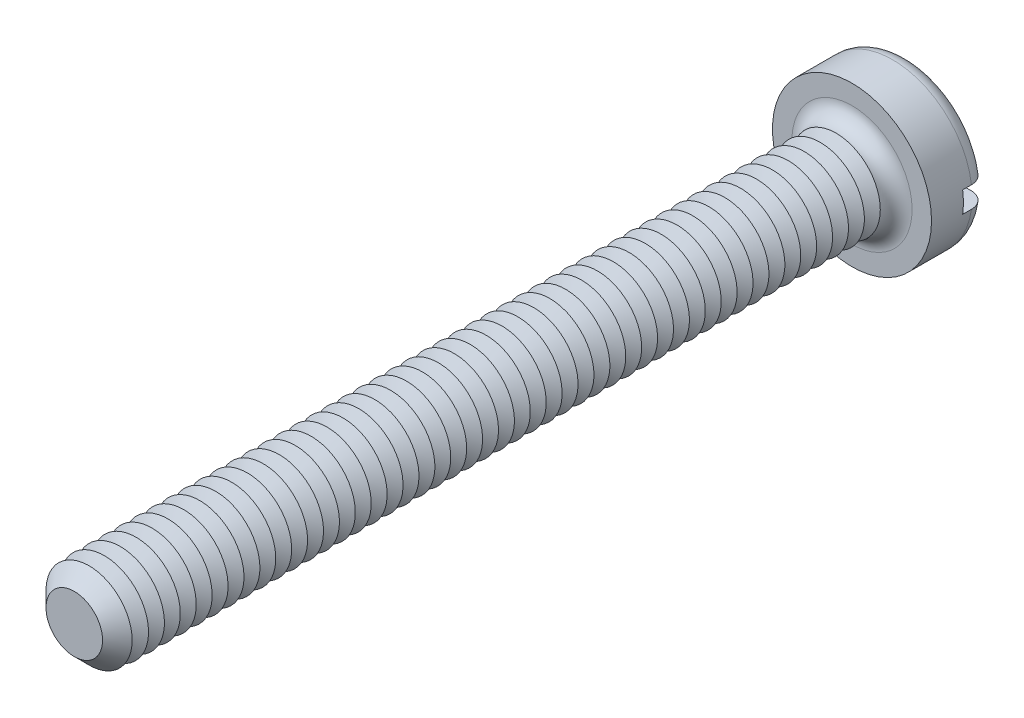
ISO-10303-21;
HEADER;
FILE_DESCRIPTION(('STEP AP214'),'2;1');
FILE_NAME('part.step','',(''),(''),'','','');
FILE_SCHEMA(('AUTOMOTIVE_DESIGN { 1 0 10303 214 1 1 1 1 }'));
ENDSEC;
DATA;
#1=APPLICATION_CONTEXT('core data for automotive mechanical design processes');
#2=APPLICATION_PROTOCOL_DEFINITION('international standard','automotive_design',2000,#1);
#3=PRODUCT_CONTEXT('',#1,'mechanical');
#4=PRODUCT('Part','Part','',(#3));
#5=PRODUCT_RELATED_PRODUCT_CATEGORY('part','',(#4));
#6=PRODUCT_DEFINITION_FORMATION('','',#4);
#7=PRODUCT_DEFINITION_CONTEXT('part definition',#1,'design');
#8=PRODUCT_DEFINITION('design','',#6,#7);
#9=PRODUCT_DEFINITION_SHAPE('','',#8);
#10=(LENGTH_UNIT() NAMED_UNIT(*) SI_UNIT(.MILLI.,.METRE.));
#11=(NAMED_UNIT(*) PLANE_ANGLE_UNIT() SI_UNIT($,.RADIAN.));
#12=(NAMED_UNIT(*) SI_UNIT($,.STERADIAN.) SOLID_ANGLE_UNIT());
#13=UNCERTAINTY_MEASURE_WITH_UNIT(LENGTH_MEASURE(1.E-05),#10,'distance_accuracy_value','');
#14=(GEOMETRIC_REPRESENTATION_CONTEXT(3) GLOBAL_UNCERTAINTY_ASSIGNED_CONTEXT((#13)) GLOBAL_UNIT_ASSIGNED_CONTEXT((#10,
#11,#12)) REPRESENTATION_CONTEXT('',''));
#15=CARTESIAN_POINT('',(0.,0.,0.));
#16=DIRECTION('',(0.,0.,1.));
#17=DIRECTION('',(1.,0.,0.));
#18=AXIS2_PLACEMENT_3D('',#15,#16,#17);
#19=CARTESIAN_POINT('',(0.,0.,-1.6));
#20=DIRECTION('',(0.,0.,1.));
#21=DIRECTION('',(1.,0.,0.));
#22=AXIS2_PLACEMENT_3D('',#19,#20,#21);
#23=PLANE('',#22);
#24=CARTESIAN_POINT('',(0.,0.,-1.6));
#25=DIRECTION('',(0.,0.,1.));
#26=DIRECTION('',(1.,0.,0.));
#27=AXIS2_PLACEMENT_3D('',#24,#25,#26);
#28=CIRCLE('',#27,1.8);
#29=CARTESIAN_POINT('',(-1.77482393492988,0.3,-1.6));
#30=VERTEX_POINT('',#29);
#31=CARTESIAN_POINT('',(1.77482393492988,0.3,-1.6));
#32=VERTEX_POINT('',#31);
#33=EDGE_CURVE('E116',#30,#32,#28,.F.);
#34=ORIENTED_EDGE('',*,*,#33,.T.);
#35=DIRECTION('',(1.,0.,0.));
#36=VECTOR('',#35,1.);
#37=CARTESIAN_POINT('',(-2.25,0.3,-1.6));
#38=LINE('',#37,#36);
#39=EDGE_CURVE('E111',#30,#32,#38,.T.);
#40=ORIENTED_EDGE('',*,*,#39,.F.);
#41=EDGE_LOOP('',(#34,#40));
#42=FACE_BOUND('',#41,.T.);
#43=ADVANCED_FACE('F39',(#42),#23,.F.);
#44=CARTESIAN_POINT('',(0.,0.,-1.15));
#45=DIRECTION('',(0.,0.,1.));
#46=DIRECTION('',(1.,0.,0.));
#47=AXIS2_PLACEMENT_3D('',#44,#45,#46);
#48=TOROIDAL_SURFACE('',#47,1.8,0.45);
#49=CARTESIAN_POINT('',(-2.09367249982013,0.3,-1.4713087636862));
#50=CARTESIAN_POINT('',(-2.07531034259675,0.3,-1.48912990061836));
#51=CARTESIAN_POINT('',(-2.05541605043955,0.3,-1.50540110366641));
#52=CARTESIAN_POINT('',(-2.01315405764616,0.3,-1.53437465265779));
#53=CARTESIAN_POINT('',(-1.99078310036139,0.3,-1.54707221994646));
#54=CARTESIAN_POINT('',(-1.94425163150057,0.3,-1.56853090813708));
#55=CARTESIAN_POINT('',(-1.92009286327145,0.3,-1.57729580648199));
#56=CARTESIAN_POINT('',(-1.8706617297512,0.3,-1.59068015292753));
#57=CARTESIAN_POINT('',(-1.84538964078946,0.3,-1.59530062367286));
#58=CARTESIAN_POINT('',(-1.7942134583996,0.3,-1.60031507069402));
#59=CARTESIAN_POINT('',(-1.76830582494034,0.3,-1.60067291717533));
#60=CARTESIAN_POINT('',(-1.71679040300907,0.3,-1.59707477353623));
#61=CARTESIAN_POINT('',(-1.69118264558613,0.3,-1.59311834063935));
#62=CARTESIAN_POINT('',(-1.64075792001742,0.3,-1.58095464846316));
#63=CARTESIAN_POINT('',(-1.61594989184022,0.3,-1.57271029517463));
#64=CARTESIAN_POINT('',(-1.56806655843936,0.3,-1.55217762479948));
#65=CARTESIAN_POINT('',(-1.54499130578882,0.3,-1.53988918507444));
#66=CARTESIAN_POINT('',(-1.50122413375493,0.3,-1.51158963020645));
#67=CARTESIAN_POINT('',(-1.48053389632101,0.3,-1.49557591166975));
#68=CARTESIAN_POINT('',(-1.44217532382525,0.3,-1.46026359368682));
#69=CARTESIAN_POINT('',(-1.42450683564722,0.3,-1.4409651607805));
#70=CARTESIAN_POINT('',(-1.39293961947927,0.3,-1.39986821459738));
#71=CARTESIAN_POINT('',(-1.37899788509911,0.3,-1.37810275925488));
#72=CARTESIAN_POINT('',(-1.35506190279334,0.3,-1.33249939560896));
#73=CARTESIAN_POINT('',(-1.34506709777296,0.3,-1.30866178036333));
#74=CARTESIAN_POINT('',(-1.3295415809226,0.3,-1.26015137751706));
#75=CARTESIAN_POINT('',(-1.32391771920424,0.3,-1.23550839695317));
#76=CARTESIAN_POINT('',(-1.31696995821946,0.3,-1.18562442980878));
#77=CARTESIAN_POINT('',(-1.31564552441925,0.3,-1.16038351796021));
#78=CARTESIAN_POINT('',(-1.31732714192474,0.3,-1.11049178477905));
#79=CARTESIAN_POINT('',(-1.32025766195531,0.3,-1.08583837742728));
#80=CARTESIAN_POINT('',(-1.3302124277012,0.3,-1.03737369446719));
#81=CARTESIAN_POINT('',(-1.33723664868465,0.3,-1.01356241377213));
#82=CARTESIAN_POINT('',(-1.35515820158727,0.3,-0.967413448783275));
#83=CARTESIAN_POINT('',(-1.36606032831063,0.3,-0.945077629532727));
#84=CARTESIAN_POINT('',(-1.39139351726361,0.3,-0.902507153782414));
#85=CARTESIAN_POINT('',(-1.40582489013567,0.3,-0.882272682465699));
#86=CARTESIAN_POINT('',(-1.43808691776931,0.3,-0.844072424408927));
#87=CARTESIAN_POINT('',(-1.4559757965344,0.3,-0.826155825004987));
#88=CARTESIAN_POINT('',(-1.49445205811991,0.3,-0.793502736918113));
#89=CARTESIAN_POINT('',(-1.51503974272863,0.3,-0.778766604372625));
#90=CARTESIAN_POINT('',(-1.55880475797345,0.3,-0.752571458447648));
#91=CARTESIAN_POINT('',(-1.58202794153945,0.3,-0.741189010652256));
#92=CARTESIAN_POINT('',(-1.63004083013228,0.3,-0.722432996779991));
#93=CARTESIAN_POINT('',(-1.65483064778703,0.3,-0.715059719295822));
#94=CARTESIAN_POINT('',(-1.70558060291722,0.3,-0.704463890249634));
#95=CARTESIAN_POINT('',(-1.73155090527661,0.3,-0.701289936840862));
#96=CARTESIAN_POINT('',(-1.78365633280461,0.3,-0.699350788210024));
#97=CARTESIAN_POINT('',(-1.80979145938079,0.3,-0.700585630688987));
#98=CARTESIAN_POINT('',(-1.86145503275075,0.3,-0.70744393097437));
#99=CARTESIAN_POINT('',(-1.88698403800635,0.3,-0.713063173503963));
#100=CARTESIAN_POINT('',(-1.93672112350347,0.3,-0.728546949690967));
#101=CARTESIAN_POINT('',(-1.96092925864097,0.3,-0.738411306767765));
#102=CARTESIAN_POINT('',(-2.00710191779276,0.3,-0.762015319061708));
#103=CARTESIAN_POINT('',(-2.02908465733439,0.3,-0.775719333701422));
#104=CARTESIAN_POINT('',(-2.0704025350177,0.3,-0.806663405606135));
#105=CARTESIAN_POINT('',(-2.08973782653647,0.3,-0.823903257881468));
#106=CARTESIAN_POINT('',(-2.12497879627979,0.3,-0.861218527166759));
#107=CARTESIAN_POINT('',(-2.1409209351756,0.3,-0.881259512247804));
#108=CARTESIAN_POINT('',(-2.16917502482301,0.3,-0.92375535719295));
#109=CARTESIAN_POINT('',(-2.18148717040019,0.3,-0.946210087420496));
#110=CARTESIAN_POINT('',(-2.20201023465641,0.3,-0.99266079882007));
#111=CARTESIAN_POINT('',(-2.21025973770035,0.3,-1.01663973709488));
#112=CARTESIAN_POINT('',(-2.22258852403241,0.3,-1.06564563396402));
#113=CARTESIAN_POINT('',(-2.22666813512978,0.3,-1.0906725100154));
#114=CARTESIAN_POINT('',(-2.23052418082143,0.3,-1.14090288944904));
#115=CARTESIAN_POINT('',(-2.23032644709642,0.3,-1.16610441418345));
#116=CARTESIAN_POINT('',(-2.22569614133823,0.3,-1.21612212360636));
#117=CARTESIAN_POINT('',(-2.2212625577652,0.3,-1.24093821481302));
#118=CARTESIAN_POINT('',(-2.20829785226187,0.3,-1.2894516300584));
#119=CARTESIAN_POINT('',(-2.19976997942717,0.3,-1.31314982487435));
#120=CARTESIAN_POINT('',(-2.17887390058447,0.3,-1.35876313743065));
#121=CARTESIAN_POINT('',(-2.1665103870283,0.3,-1.3806803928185));
#122=CARTESIAN_POINT('',(-2.14384463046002,0.3,-1.4140108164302));
#123=CARTESIAN_POINT('',(-2.13462949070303,0.3,-1.42617780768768));
#124=CARTESIAN_POINT('',(-2.1150151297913,0.3,-1.44951629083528));
#125=CARTESIAN_POINT('',(-2.10461591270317,0.3,-1.46068778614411));
#126=CARTESIAN_POINT('',(-2.09367249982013,0.3,-1.4713087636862));
#127=B_SPLINE_CURVE_WITH_KNOTS('',3,(#49,#50,#51,#52,#53,#54,#55,#56,#57,#58,#59,#60,#61,#62,
#63,#64,#65,#66,#67,#68,#69,#70,#71,#72,#73,#74,#75,#76,#77,#78,#79,#80,#81,#82,#83,#84,#85,#86,
#87,#88,#89,#90,#91,#92,#93,#94,#95,#96,#97,#98,#99,#100,#101,#102,#103,#104,#105,#106,#107,
#108,#109,#110,#111,#112,#113,#114,#115,#116,#117,#118,#119,#120,#121,#122,#123,#124,#125,#126),
.UNSPECIFIED.,.T.,.F.,(4,2,2,2,2,2,2,2,2,2,2,2,2,2,2,2,2,2,2,2,2,2,2,2,2,2,2,2,2,2,2,2,2,2,2,2,
2,2,4),(0.,0.0767085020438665,0.153519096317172,0.230255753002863,0.306973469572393,
0.384340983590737,0.461716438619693,0.539772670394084,0.617831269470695,0.695944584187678,
0.774053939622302,0.851218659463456,0.928372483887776,1.00383319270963,1.07928451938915,
1.15341274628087,1.22754052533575,1.30176027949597,1.37598656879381,1.45159320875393,
1.52720831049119,1.6044355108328,1.68166826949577,1.75978723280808,1.8379068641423,
1.91595148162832,1.99399285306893,2.07133254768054,2.14866775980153,2.22512456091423,
2.30157725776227,2.3772891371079,2.45299506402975,2.52824391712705,2.60351074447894,
2.67871794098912,2.75383349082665,2.79955010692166,2.84526656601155),.UNSPECIFIED.);
#128=CARTESIAN_POINT('',(-2.22991031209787,0.3,-1.14999999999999));
#129=VERTEX_POINT('',#128);
#130=EDGE_CURVE('E561',#129,#30,#127,.T.);
#131=ORIENTED_EDGE('',*,*,#130,.F.);
#132=CARTESIAN_POINT('',(0.,0.,-1.15));
#133=DIRECTION('',(0.,0.,1.));
#134=DIRECTION('',(1.,0.,0.));
#135=AXIS2_PLACEMENT_3D('',#132,#133,#134);
#136=CIRCLE('',#135,2.25);
#137=CARTESIAN_POINT('',(2.22991031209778,0.3,-1.15));
#138=VERTEX_POINT('',#137);
#139=EDGE_CURVE('E125',#138,#129,#136,.T.);
#140=ORIENTED_EDGE('',*,*,#139,.F.);
#141=CARTESIAN_POINT('',(1.39325818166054,0.3,-1.39903402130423));
#142=CARTESIAN_POINT('',(1.40771723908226,0.3,-1.42030595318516));
#143=CARTESIAN_POINT('',(1.4240122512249,0.3,-1.4403555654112));
#144=CARTESIAN_POINT('',(1.45976320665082,0.3,-1.4774406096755));
#145=CARTESIAN_POINT('',(1.47922380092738,0.3,-1.49447152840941));
#146=CARTESIAN_POINT('',(1.5206923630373,0.3,-1.52502510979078));
#147=CARTESIAN_POINT('',(1.54269721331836,0.3,-1.53855200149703));
#148=CARTESIAN_POINT('',(1.58863815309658,0.3,-1.56176272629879));
#149=CARTESIAN_POINT('',(1.61257369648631,0.3,-1.57144764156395));
#150=CARTESIAN_POINT('',(1.66199169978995,0.3,-1.58680804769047));
#151=CARTESIAN_POINT('',(1.68748839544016,0.3,-1.59243778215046));
#152=CARTESIAN_POINT('',(1.73906656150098,0.3,-1.59934902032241));
#153=CARTESIAN_POINT('',(1.76514807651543,0.3,-1.60063019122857));
#154=CARTESIAN_POINT('',(1.81721740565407,0.3,-1.59879130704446));
#155=CARTESIAN_POINT('',(1.84320486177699,0.3,-1.59566102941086));
#156=CARTESIAN_POINT('',(1.89427635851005,0.3,-1.58504931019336));
#157=CARTESIAN_POINT('',(1.91936042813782,0.3,-1.57756800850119));
#158=CARTESIAN_POINT('',(1.9677137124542,0.3,-1.55851722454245));
#159=CARTESIAN_POINT('',(1.99099484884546,0.3,-1.5469780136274));
#160=CARTESIAN_POINT('',(2.03525897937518,0.3,-1.52011224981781));
#161=CARTESIAN_POINT('',(2.05624211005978,0.3,-1.50478592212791));
#162=CARTESIAN_POINT('',(2.09506403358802,0.3,-1.47096472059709));
#163=CARTESIAN_POINT('',(2.11293536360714,0.3,-1.45250719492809));
#164=CARTESIAN_POINT('',(2.14528563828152,0.3,-1.41282609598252));
#165=CARTESIAN_POINT('',(2.15976477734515,0.3,-1.39160268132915));
#166=CARTESIAN_POINT('',(2.18476262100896,0.3,-1.34723254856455));
#167=CARTESIAN_POINT('',(2.19532119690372,0.3,-1.32410828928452));
#168=CARTESIAN_POINT('',(2.21237438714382,0.3,-1.27640693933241));
#169=CARTESIAN_POINT('',(2.21886918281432,0.3,-1.25182991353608));
#170=CARTESIAN_POINT('',(2.2275687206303,0.3,-1.20210937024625));
#171=CARTESIAN_POINT('',(2.22980376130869,0.3,-1.17697115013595));
#172=CARTESIAN_POINT('',(2.23000940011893,0.3,-1.12667754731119));
#173=CARTESIAN_POINT('',(2.22798009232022,0.3,-1.10152216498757));
#174=CARTESIAN_POINT('',(2.21972856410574,0.3,-1.05197773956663));
#175=CARTESIAN_POINT('',(2.21351744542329,0.3,-1.02758684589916));
#176=CARTESIAN_POINT('',(2.19709696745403,0.3,-0.980190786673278));
#177=CARTESIAN_POINT('',(2.18688760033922,0.3,-0.957185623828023));
#178=CARTESIAN_POINT('',(2.1627435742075,0.3,-0.913157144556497));
#179=CARTESIAN_POINT('',(2.14880093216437,0.3,-0.892138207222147));
#180=CARTESIAN_POINT('',(2.11760640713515,0.3,-0.852719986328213));
#181=CARTESIAN_POINT('',(2.10035443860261,0.3,-0.834320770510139));
#182=CARTESIAN_POINT('',(2.06291254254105,0.3,-0.80052923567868));
#183=CARTESIAN_POINT('',(2.04270386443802,0.3,-0.785157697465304));
#184=CARTESIAN_POINT('',(2.0000139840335,0.3,-0.757986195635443));
#185=CARTESIAN_POINT('',(1.97753267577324,0.3,-0.746186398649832));
#186=CARTESIAN_POINT('',(1.93069507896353,0.3,-0.726364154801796));
#187=CARTESIAN_POINT('',(1.90632219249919,0.3,-0.718380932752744));
#188=CARTESIAN_POINT('',(1.85658993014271,0.3,-0.706569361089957));
#189=CARTESIAN_POINT('',(1.83123049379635,0.3,-0.702741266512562));
#190=CARTESIAN_POINT('',(1.77994107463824,0.3,-0.699306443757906));
#191=CARTESIAN_POINT('',(1.75400788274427,0.3,-0.69974759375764));
#192=CARTESIAN_POINT('',(1.70257608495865,0.3,-0.704939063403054));
#193=CARTESIAN_POINT('',(1.67707750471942,0.3,-0.709689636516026));
#194=CARTESIAN_POINT('',(1.62701662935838,0.3,-0.723419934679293));
#195=CARTESIAN_POINT('',(1.60246387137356,0.3,-0.732434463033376));
#196=CARTESIAN_POINT('',(1.55521886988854,0.3,-0.754458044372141));
#197=CARTESIAN_POINT('',(1.53252668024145,0.3,-0.76746721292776));
#198=CARTESIAN_POINT('',(1.48966925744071,0.3,-0.797124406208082));
#199=CARTESIAN_POINT('',(1.46950315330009,0.3,-0.813771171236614));
#200=CARTESIAN_POINT('',(1.43229728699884,0.3,-0.850255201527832));
#201=CARTESIAN_POINT('',(1.41525734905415,0.3,-0.870092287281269));
#202=CARTESIAN_POINT('',(1.3850470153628,0.3,-0.912123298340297));
#203=CARTESIAN_POINT('',(1.37182821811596,0.3,-0.934282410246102));
#204=CARTESIAN_POINT('',(1.34939737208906,0.3,-0.980542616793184));
#205=CARTESIAN_POINT('',(1.34018456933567,0.3,-1.00464334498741));
#206=CARTESIAN_POINT('',(1.32624172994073,0.3,-1.05352472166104));
#207=CARTESIAN_POINT('',(1.32141599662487,0.3,-1.07827808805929));
#208=CARTESIAN_POINT('',(1.31606478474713,0.3,-1.12825155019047));
#209=CARTESIAN_POINT('',(1.31553992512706,0.3,-1.15347171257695));
#210=CARTESIAN_POINT('',(1.31878307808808,0.3,-1.20323022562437));
#211=CARTESIAN_POINT('',(1.32248353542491,0.3,-1.22777305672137));
#212=CARTESIAN_POINT('',(1.33394086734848,0.3,-1.27586981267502));
#213=CARTESIAN_POINT('',(1.34169274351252,0.3,-1.2994249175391));
#214=CARTESIAN_POINT('',(1.35704250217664,0.3,-1.33561898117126));
#215=CARTESIAN_POINT('',(1.36341395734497,0.3,-1.34879219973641));
#216=CARTESIAN_POINT('',(1.37741190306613,0.3,-1.37445328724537));
#217=CARTESIAN_POINT('',(1.38503837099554,0.3,-1.38694116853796));
#218=CARTESIAN_POINT('',(1.39325818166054,0.3,-1.39903402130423));
#219=B_SPLINE_CURVE_WITH_KNOTS('',3,(#141,#142,#143,#144,#145,#146,#147,#148,#149,#150,#151,
#152,#153,#154,#155,#156,#157,#158,#159,#160,#161,#162,#163,#164,#165,#166,#167,#168,#169,#170,
#171,#172,#173,#174,#175,#176,#177,#178,#179,#180,#181,#182,#183,#184,#185,#186,#187,#188,#189,
#190,#191,#192,#193,#194,#195,#196,#197,#198,#199,#200,#201,#202,#203,#204,#205,#206,#207,#208,
#209,#210,#211,#212,#213,#214,#215,#216,#217,#218),.UNSPECIFIED.,.T.,.F.,(4,2,2,2,2,2,2,2,2,2,2,
2,2,2,2,2,2,2,2,2,2,2,2,2,2,2,2,2,2,2,2,2,2,2,2,2,2,2,4),(0.,0.0771077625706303,
0.154329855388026,0.231458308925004,0.308565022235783,0.386528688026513,0.464498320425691,
0.542648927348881,0.620797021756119,0.698374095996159,0.77594655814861,0.852651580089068,
0.929352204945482,1.00524992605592,1.08114426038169,1.15649673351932,1.2318475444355,
1.30699910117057,1.38215080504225,1.45746451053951,1.53278016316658,1.60859599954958,
1.68441537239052,1.76099806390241,1.83758545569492,1.91503273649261,1.99248457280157,
2.07057979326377,2.14867727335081,2.22674775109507,2.30481383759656,2.38184276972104,
2.45885719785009,2.53414829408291,2.6094502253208,2.68356487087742,2.75758829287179,
2.80142397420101,2.84525886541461),.UNSPECIFIED.);
#220=EDGE_CURVE('E563',#32,#138,#219,.T.);
#221=ORIENTED_EDGE('',*,*,#220,.F.);
#222=ORIENTED_EDGE('',*,*,#33,.F.);
#223=EDGE_LOOP('',(#131,#140,#221,#222));
#224=FACE_BOUND('',#223,.T.);
#225=ADVANCED_FACE('F545',(#224),#48,.T.);
#226=CARTESIAN_POINT('',(0.,0.,-1.6));
#227=DIRECTION('',(0.,0.,1.));
#228=DIRECTION('',(1.,0.,0.));
#229=AXIS2_PLACEMENT_3D('',#226,#227,#228);
#230=CYLINDRICAL_SURFACE('',#229,2.25);
#231=DIRECTION('',(0.,0.,1.));
#232=VECTOR('',#231,1.);
#233=CARTESIAN_POINT('',(2.22991031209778,0.3,-1.6));
#234=LINE('',#233,#232);
#235=CARTESIAN_POINT('',(2.22991031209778,0.3,-0.9));
#236=VERTEX_POINT('',#235);
#237=EDGE_CURVE('E576',#138,#236,#234,.T.);
#238=ORIENTED_EDGE('',*,*,#237,.F.);
#239=ORIENTED_EDGE('',*,*,#139,.T.);
#240=DIRECTION('',(0.,0.,1.));
#241=VECTOR('',#240,1.);
#242=CARTESIAN_POINT('',(-2.22991031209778,0.3,-1.6));
#243=LINE('',#242,#241);
#244=CARTESIAN_POINT('',(-2.22991031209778,0.3,-0.9));
#245=VERTEX_POINT('',#244);
#246=EDGE_CURVE('E63',#245,#129,#243,.F.);
#247=ORIENTED_EDGE('',*,*,#246,.F.);
#248=CARTESIAN_POINT('',(0.,0.,-0.9));
#249=DIRECTION('',(0.,0.,-1.));
#250=DIRECTION('',(-1.,0.,0.));
#251=AXIS2_PLACEMENT_3D('',#248,#249,#250);
#252=CIRCLE('',#251,2.25);
#253=CARTESIAN_POINT('',(-2.22991031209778,-0.3,-0.9));
#254=VERTEX_POINT('',#253);
#255=EDGE_CURVE('E43',#245,#254,#252,.F.);
#256=ORIENTED_EDGE('',*,*,#255,.T.);
#257=DIRECTION('',(0.,0.,1.));
#258=VECTOR('',#257,1.);
#259=CARTESIAN_POINT('',(-2.22991031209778,-0.3,-1.6));
#260=LINE('',#259,#258);
#261=CARTESIAN_POINT('',(-2.22991031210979,-0.3,-1.15000000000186));
#262=VERTEX_POINT('',#261);
#263=EDGE_CURVE('E573',#262,#254,#260,.T.);
#264=ORIENTED_EDGE('',*,*,#263,.F.);
#265=CARTESIAN_POINT('',(2.22991031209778,-0.3,-1.15));
#266=VERTEX_POINT('',#265);
#267=EDGE_CURVE('E127',#262,#266,#136,.T.);
#268=ORIENTED_EDGE('',*,*,#267,.T.);
#269=DIRECTION('',(0.,0.,1.));
#270=VECTOR('',#269,1.);
#271=CARTESIAN_POINT('',(2.22991031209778,-0.3,-1.6));
#272=LINE('',#271,#270);
#273=CARTESIAN_POINT('',(2.22991031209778,-0.3,-0.9));
#274=VERTEX_POINT('',#273);
#275=EDGE_CURVE('E55',#274,#266,#272,.F.);
#276=ORIENTED_EDGE('',*,*,#275,.F.);
#277=EDGE_CURVE('E11',#274,#236,#252,.F.);
#278=ORIENTED_EDGE('',*,*,#277,.T.);
#279=EDGE_LOOP('',(#238,#239,#247,#256,#264,#268,#276,#278));
#280=FACE_BOUND('',#279,.T.);
#281=CARTESIAN_POINT('',(0.,0.,0.));
#282=DIRECTION('',(0.,0.,1.));
#283=DIRECTION('',(1.,0.,0.));
#284=AXIS2_PLACEMENT_3D('',#281,#282,#283);
#285=CIRCLE('',#284,2.25);
#286=CARTESIAN_POINT('',(2.25,0.,0.));
#287=VERTEX_POINT('',#286);
#288=EDGE_CURVE('E579',#287,#287,#285,.T.);
#289=ORIENTED_EDGE('',*,*,#288,.F.);
#290=EDGE_LOOP('',(#289));
#291=FACE_BOUND('',#290,.T.);
#292=ADVANCED_FACE('F541',(#280,#291),#230,.T.);
#293=CARTESIAN_POINT('',(1.77482393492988,-0.3,-1.6));
#294=VERTEX_POINT('',#293);
#295=CARTESIAN_POINT('',(-1.77482393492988,-0.3,-1.6));
#296=VERTEX_POINT('',#295);
#297=EDGE_CURVE('E109',#294,#296,#28,.F.);
#298=ORIENTED_EDGE('',*,*,#297,.T.);
#299=DIRECTION('',(-1.,0.,0.));
#300=VECTOR('',#299,1.);
#301=CARTESIAN_POINT('',(-2.25,-0.3,-1.6));
#302=LINE('',#301,#300);
#303=EDGE_CURVE('E96',#294,#296,#302,.T.);
#304=ORIENTED_EDGE('',*,*,#303,.F.);
#305=EDGE_LOOP('',(#298,#304));
#306=FACE_BOUND('',#305,.T.);
#307=ADVANCED_FACE('F108',(#306),#23,.F.);
#308=CARTESIAN_POINT('',(0.,0.,0.));
#309=DIRECTION('',(0.,0.,1.));
#310=DIRECTION('',(1.,0.,0.));
#311=AXIS2_PLACEMENT_3D('',#308,#309,#310);
#312=PLANE('',#311);
#313=CARTESIAN_POINT('',(0.,0.,0.));
#314=DIRECTION('',(0.,0.,1.));
#315=DIRECTION('',(1.,0.,0.));
#316=AXIS2_PLACEMENT_3D('',#313,#314,#315);
#317=CIRCLE('',#316,1.7);
#318=CARTESIAN_POINT('',(1.7,0.,0.));
#319=VERTEX_POINT('',#318);
#320=EDGE_CURVE('E115',#319,#319,#317,.F.);
#321=ORIENTED_EDGE('',*,*,#320,.T.);
#322=EDGE_LOOP('',(#321));
#323=FACE_BOUND('',#322,.T.);
#324=ORIENTED_EDGE('',*,*,#288,.T.);
#325=EDGE_LOOP('',(#324));
#326=FACE_BOUND('',#325,.T.);
#327=ADVANCED_FACE('F540',(#323,#326),#312,.T.);
#328=CARTESIAN_POINT('',(-2.09367249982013,-0.3,-1.4713087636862));
#329=CARTESIAN_POINT('',(-2.11176539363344,-0.3,-1.45374579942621));
#330=CARTESIAN_POINT('',(-2.1283968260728,-0.3,-1.43465254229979));
#331=CARTESIAN_POINT('',(-2.15823692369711,-0.3,-1.39393307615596));
#332=CARTESIAN_POINT('',(-2.17144184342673,-0.3,-1.37230413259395));
#333=CARTESIAN_POINT('',(-2.19402281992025,-0.3,-1.32713362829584));
#334=CARTESIAN_POINT('',(-2.20339951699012,-0.3,-1.30359238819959));
#335=CARTESIAN_POINT('',(-2.21804409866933,-0.3,-1.25527081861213));
#336=CARTESIAN_POINT('',(-2.22331295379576,-0.3,-1.23049078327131));
#337=CARTESIAN_POINT('',(-2.22957448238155,-0.3,-1.18050893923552));
#338=CARTESIAN_POINT('',(-2.23058617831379,-0.3,-1.15530951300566));
#339=CARTESIAN_POINT('',(-2.22835535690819,-0.3,-1.10509920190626));
#340=CARTESIAN_POINT('',(-2.22511277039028,-0.3,-1.08008832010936));
#341=CARTESIAN_POINT('',(-2.21448018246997,-0.3,-1.03101646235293));
#342=CARTESIAN_POINT('',(-2.20709836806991,-0.3,-1.00695371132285));
#343=CARTESIAN_POINT('',(-2.18841075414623,-0.3,-0.960404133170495));
#344=CARTESIAN_POINT('',(-2.17710493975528,-0.3,-0.937917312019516));
#345=CARTESIAN_POINT('',(-2.15086234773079,-0.3,-0.895085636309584));
#346=CARTESIAN_POINT('',(-2.13591537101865,-0.3,-0.874747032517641));
#347=CARTESIAN_POINT('',(-2.1028415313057,-0.3,-0.836845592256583));
#348=CARTESIAN_POINT('',(-2.08471458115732,-0.3,-0.819282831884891));
#349=CARTESIAN_POINT('',(-2.0456590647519,-0.3,-0.78729174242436));
#350=CARTESIAN_POINT('',(-2.0247112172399,-0.3,-0.772886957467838));
#351=CARTESIAN_POINT('',(-1.98071452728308,-0.3,-0.747756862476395));
#352=CARTESIAN_POINT('',(-1.95766557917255,-0.3,-0.737031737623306));
#353=CARTESIAN_POINT('',(-1.90986554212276,-0.3,-0.71944451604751));
#354=CARTESIAN_POINT('',(-1.88509923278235,-0.3,-0.712623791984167));
#355=CARTESIAN_POINT('',(-1.83477837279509,-0.3,-0.703186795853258));
#356=CARTESIAN_POINT('',(-1.80922377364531,-0.3,-0.700570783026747));
#357=CARTESIAN_POINT('',(-1.75774893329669,-0.3,-0.699591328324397));
#358=CARTESIAN_POINT('',(-1.73182778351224,-0.3,-0.701275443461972));
#359=CARTESIAN_POINT('',(-1.68062744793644,-0.3,-0.708937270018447));
#360=CARTESIAN_POINT('',(-1.65534829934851,-0.3,-0.714915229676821));
#361=CARTESIAN_POINT('',(-1.6059539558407,-0.3,-0.731056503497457));
#362=CARTESIAN_POINT('',(-1.58184881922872,-0.3,-0.741250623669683));
#363=CARTESIAN_POINT('',(-1.53569497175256,-0.3,-0.765548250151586));
#364=CARTESIAN_POINT('',(-1.51364629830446,-0.3,-0.779651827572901));
#365=CARTESIAN_POINT('',(-1.47229470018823,-0.3,-0.811355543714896));
#366=CARTESIAN_POINT('',(-1.45298625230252,-0.3,-0.828948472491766));
#367=CARTESIAN_POINT('',(-1.41765142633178,-0.3,-0.867170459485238));
#368=CARTESIAN_POINT('',(-1.40162480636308,-0.3,-0.887799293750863));
#369=CARTESIAN_POINT('',(-1.37358365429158,-0.3,-0.93118317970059));
#370=CARTESIAN_POINT('',(-1.3615121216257,-0.3,-0.953901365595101));
#371=CARTESIAN_POINT('',(-1.34145576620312,-0.3,-1.00107529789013));
#372=CARTESIAN_POINT('',(-1.33347032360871,-0.3,-1.02553078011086));
#373=CARTESIAN_POINT('',(-1.32199536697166,-0.3,-1.07489401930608));
#374=CARTESIAN_POINT('',(-1.31840873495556,-0.3,-1.09977921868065));
#375=CARTESIAN_POINT('',(-1.31553052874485,-0.3,-1.1497957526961));
#376=CARTESIAN_POINT('',(-1.31623852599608,-0.3,-1.17492706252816));
#377=CARTESIAN_POINT('',(-1.32188368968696,-0.3,-1.22435119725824));
#378=CARTESIAN_POINT('',(-1.32676151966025,-0.3,-1.24865083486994));
#379=CARTESIAN_POINT('',(-1.34050334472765,-0.3,-1.29609421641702));
#380=CARTESIAN_POINT('',(-1.34936742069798,-0.3,-1.31923793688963));
#381=CARTESIAN_POINT('',(-1.37086295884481,-0.3,-1.36387796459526));
#382=CARTESIAN_POINT('',(-1.38351729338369,-0.3,-1.38536324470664));
#383=CARTESIAN_POINT('',(-1.41218367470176,-0.3,-1.42596199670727));
#384=CARTESIAN_POINT('',(-1.42819606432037,-0.3,-1.44507522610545));
#385=CARTESIAN_POINT('',(-1.46347664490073,-0.3,-1.48081087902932));
#386=CARTESIAN_POINT('',(-1.48280543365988,-0.3,-1.49737347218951));
#387=CARTESIAN_POINT('',(-1.5239232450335,-0.3,-1.52709508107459));
#388=CARTESIAN_POINT('',(-1.54571253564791,-0.3,-1.54025372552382));
#389=CARTESIAN_POINT('',(-1.59160097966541,-0.3,-1.56305446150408));
#390=CARTESIAN_POINT('',(-1.61573734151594,-0.3,-1.57262172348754));
#391=CARTESIAN_POINT('',(-1.66526504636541,-0.3,-1.58760700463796));
#392=CARTESIAN_POINT('',(-1.69065641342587,-0.3,-1.59302494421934));
#393=CARTESIAN_POINT('',(-1.74220154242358,-0.3,-1.59958446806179));
#394=CARTESIAN_POINT('',(-1.7683598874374,-0.3,-1.60069012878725));
#395=CARTESIAN_POINT('',(-1.82049681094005,-0.3,-1.59847888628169));
#396=CARTESIAN_POINT('',(-1.8464753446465,-0.3,-1.59516091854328));
#397=CARTESIAN_POINT('',(-1.89742078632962,-0.3,-1.58419269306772));
#398=CARTESIAN_POINT('',(-1.92239041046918,-0.3,-1.57655503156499));
#399=CARTESIAN_POINT('',(-1.97064988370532,-0.3,-1.55715679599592));
#400=CARTESIAN_POINT('',(-1.99394179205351,-0.3,-1.54540138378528));
#401=CARTESIAN_POINT('',(-2.03003215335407,-0.3,-1.52312594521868));
#402=CARTESIAN_POINT('',(-2.04354254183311,-0.3,-1.51373809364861));
#403=CARTESIAN_POINT('',(-2.06946640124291,-0.3,-1.49355310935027));
#404=CARTESIAN_POINT('',(-2.08187987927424,-0.3,-1.48275598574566));
#405=CARTESIAN_POINT('',(-2.09367249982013,-0.3,-1.4713087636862));
#406=B_SPLINE_CURVE_WITH_KNOTS('',3,(#328,#329,#330,#331,#332,#333,#334,#335,#336,#337,#338,
#339,#340,#341,#342,#343,#344,#345,#346,#347,#348,#349,#350,#351,#352,#353,#354,#355,#356,#357,
#358,#359,#360,#361,#362,#363,#364,#365,#366,#367,#368,#369,#370,#371,#372,#373,#374,#375,#376,
#377,#378,#379,#380,#381,#382,#383,#384,#385,#386,#387,#388,#389,#390,#391,#392,#393,#394,#395,
#396,#397,#398,#399,#400,#401,#402,#403,#404,#405),.UNSPECIFIED.,.T.,.F.,(4,2,2,2,2,2,2,2,2,2,2,
2,2,2,2,2,2,2,2,2,2,2,2,2,2,2,2,2,2,2,2,2,2,2,2,2,2,2,4),(0.,0.0755864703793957,
0.151255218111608,0.226911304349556,0.302549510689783,0.377849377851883,0.453150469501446,
0.528303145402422,0.603456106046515,0.67882204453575,0.754190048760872,0.83010216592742,
0.906018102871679,0.982724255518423,1.05943513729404,1.13699806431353,1.21456547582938,
1.29270994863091,1.37085584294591,1.44884191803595,1.52682224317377,1.60362346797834,
1.68041303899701,1.75547480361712,1.83052907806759,1.90453278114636,1.97853798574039,
2.05299909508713,2.12746781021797,2.20347986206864,2.27950020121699,2.3570265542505,
2.43455439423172,2.5127267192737,2.59091785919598,2.66888216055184,2.74674907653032,
2.79601528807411,2.84528118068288),.UNSPECIFIED.);
#407=EDGE_CURVE('E103',#296,#262,#406,.T.);
#408=ORIENTED_EDGE('',*,*,#407,.F.);
#409=ORIENTED_EDGE('',*,*,#297,.F.);
#410=CARTESIAN_POINT('',(1.39325818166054,-0.3,-1.39903402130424));
#411=CARTESIAN_POINT('',(1.37924349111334,-0.3,-1.37841200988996));
#412=CARTESIAN_POINT('',(1.36693374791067,-0.3,-1.35661225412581));
#413=CARTESIAN_POINT('',(1.34612289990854,-0.3,-1.31124547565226));
#414=CARTESIAN_POINT('',(1.33762533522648,-0.3,-1.28767683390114));
#415=CARTESIAN_POINT('',(1.32472877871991,-0.3,-1.23943261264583));
#416=CARTESIAN_POINT('',(1.3203309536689,-0.3,-1.21475672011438));
#417=CARTESIAN_POINT('',(1.31579198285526,-0.3,-1.16502199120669));
#418=CARTESIAN_POINT('',(1.31564980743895,-0.3,-1.13996324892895));
#419=CARTESIAN_POINT('',(1.31960322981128,-0.3,-1.09044336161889));
#420=CARTESIAN_POINT('',(1.32365524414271,-0.3,-1.06597872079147));
#421=CARTESIAN_POINT('',(1.33579339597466,-0.3,-1.01807218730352));
#422=CARTESIAN_POINT('',(1.34387971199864,-0.3,-0.994630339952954));
#423=CARTESIAN_POINT('',(1.36386460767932,-0.3,-0.949319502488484));
#424=CARTESIAN_POINT('',(1.37577869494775,-0.3,-0.92745736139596));
#425=CARTESIAN_POINT('',(1.40303929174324,-0.3,-0.885990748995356));
#426=CARTESIAN_POINT('',(1.41838612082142,-0.3,-0.866386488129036));
#427=CARTESIAN_POINT('',(1.45239955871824,-0.3,-0.829572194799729));
#428=CARTESIAN_POINT('',(1.47112624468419,-0.3,-0.812417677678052));
#429=CARTESIAN_POINT('',(1.51114353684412,-0.3,-0.78141873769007));
#430=CARTESIAN_POINT('',(1.53243442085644,-0.3,-0.767574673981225));
#431=CARTESIAN_POINT('',(1.57744959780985,-0.3,-0.743302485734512));
#432=CARTESIAN_POINT('',(1.6012148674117,-0.3,-0.732950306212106));
#433=CARTESIAN_POINT('',(1.65013556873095,-0.3,-0.71633816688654));
#434=CARTESIAN_POINT('',(1.67529109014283,-0.3,-0.710078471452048));
#435=CARTESIAN_POINT('',(1.72654223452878,-0.3,-0.701786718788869));
#436=CARTESIAN_POINT('',(1.75264462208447,-0.3,-0.699796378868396));
#437=CARTESIAN_POINT('',(1.80481283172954,-0.3,-0.700236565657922));
#438=CARTESIAN_POINT('',(1.83087865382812,-0.3,-0.702667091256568));
#439=CARTESIAN_POINT('',(1.88216421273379,-0.3,-0.71188843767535));
#440=CARTESIAN_POINT('',(1.90738581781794,-0.3,-0.718668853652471));
#441=CARTESIAN_POINT('',(1.95631449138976,-0.3,-0.736408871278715));
#442=CARTESIAN_POINT('',(1.98002162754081,-0.3,-0.747368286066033));
#443=CARTESIAN_POINT('',(2.02500221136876,-0.3,-0.773046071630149));
#444=CARTESIAN_POINT('',(2.04629687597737,-0.3,-0.78772726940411));
#445=CARTESIAN_POINT('',(2.08608258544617,-0.3,-0.820494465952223));
#446=CARTESIAN_POINT('',(2.10457379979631,-0.3,-0.838580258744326));
#447=CARTESIAN_POINT('',(2.1380062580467,-0.3,-0.877422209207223));
#448=CARTESIAN_POINT('',(2.15298532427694,-0.3,-0.898145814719));
#449=CARTESIAN_POINT('',(2.17921311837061,-0.3,-0.941832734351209));
#450=CARTESIAN_POINT('',(2.19046204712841,-0.3,-0.964795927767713));
#451=CARTESIAN_POINT('',(2.20880507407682,-0.3,-1.01207981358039));
#452=CARTESIAN_POINT('',(2.2159367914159,-0.3,-1.0363859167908));
#453=CARTESIAN_POINT('',(2.22599386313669,-0.3,-1.08585317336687));
#454=CARTESIAN_POINT('',(2.22891936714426,-0.3,-1.11101429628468));
#455=CARTESIAN_POINT('',(2.23047255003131,-0.3,-1.16133395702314));
#456=CARTESIAN_POINT('',(2.22912306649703,-0.3,-1.18649179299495));
#457=CARTESIAN_POINT('',(2.22221641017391,-0.3,-1.236222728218));
#458=CARTESIAN_POINT('',(2.21665928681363,-0.3,-1.26079583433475));
#459=CARTESIAN_POINT('',(2.20150655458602,-0.3,-1.30864604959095));
#460=CARTESIAN_POINT('',(2.19191347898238,-0.3,-1.3319239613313));
#461=CARTESIAN_POINT('',(2.16897085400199,-0.3,-1.37654778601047));
#462=CARTESIAN_POINT('',(2.15562126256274,-0.3,-1.39789367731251));
#463=CARTESIAN_POINT('',(2.12549147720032,-0.3,-1.43814583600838));
#464=CARTESIAN_POINT('',(2.1086973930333,-0.3,-1.45704170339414));
#465=CARTESIAN_POINT('',(2.07219852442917,-0.3,-1.491773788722));
#466=CARTESIAN_POINT('',(2.0524936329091,-0.3,-1.50760989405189));
#467=CARTESIAN_POINT('',(2.01056127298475,-0.3,-1.53591667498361));
#468=CARTESIAN_POINT('',(1.98831430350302,-0.3,-1.54835845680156));
#469=CARTESIAN_POINT('',(1.94206418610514,-0.3,-1.5693763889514));
#470=CARTESIAN_POINT('',(1.91806093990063,-0.3,-1.57795232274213));
#471=CARTESIAN_POINT('',(1.86869953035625,-0.3,-1.5910955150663));
#472=CARTESIAN_POINT('',(1.84332941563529,-0.3,-1.59561788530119));
#473=CARTESIAN_POINT('',(1.7921914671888,-0.3,-1.60038767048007));
#474=CARTESIAN_POINT('',(1.76642362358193,-0.3,-1.60063497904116));
#475=CARTESIAN_POINT('',(1.71493241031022,-0.3,-1.59684388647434));
#476=CARTESIAN_POINT('',(1.6892123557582,-0.3,-1.59276040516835));
#477=CARTESIAN_POINT('',(1.63880694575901,-0.3,-1.58035661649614));
#478=CARTESIAN_POINT('',(1.61412189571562,-0.3,-1.5720350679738));
#479=CARTESIAN_POINT('',(1.56635013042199,-0.3,-1.55132424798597));
#480=CARTESIAN_POINT('',(1.54327365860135,-0.3,-1.53891136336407));
#481=CARTESIAN_POINT('',(1.49956705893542,-0.3,-1.51037484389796));
#482=CARTESIAN_POINT('',(1.478934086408,-0.3,-1.49425558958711));
#483=CARTESIAN_POINT('',(1.44732882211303,-0.3,-1.46489751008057));
#484=CARTESIAN_POINT('',(1.43548118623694,-0.3,-1.45258668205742));
#485=CARTESIAN_POINT('',(1.41324217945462,-0.3,-1.42671249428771));
#486=CARTESIAN_POINT('',(1.40285079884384,-0.3,-1.41314914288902));
#487=CARTESIAN_POINT('',(1.39325818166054,-0.3,-1.39903402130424));
#488=B_SPLINE_CURVE_WITH_KNOTS('',3,(#410,#411,#412,#413,#414,#415,#416,#417,#418,#419,#420,
#421,#422,#423,#424,#425,#426,#427,#428,#429,#430,#431,#432,#433,#434,#435,#436,#437,#438,#439,
#440,#441,#442,#443,#444,#445,#446,#447,#448,#449,#450,#451,#452,#453,#454,#455,#456,#457,#458,
#459,#460,#461,#462,#463,#464,#465,#466,#467,#468,#469,#470,#471,#472,#473,#474,#475,#476,#477,
#478,#479,#480,#481,#482,#483,#484,#485,#486,#487),.UNSPECIFIED.,.T.,.F.,(4,2,2,2,2,2,2,2,2,2,2,
2,2,2,2,2,2,2,2,2,2,2,2,2,2,2,2,2,2,2,2,2,2,2,2,2,2,2,4),(0.,0.0747398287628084,
0.149548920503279,0.224379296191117,0.29919156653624,0.373234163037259,0.447280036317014,
0.521629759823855,0.595986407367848,0.671825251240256,0.747672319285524,0.825076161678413,
0.902485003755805,0.980646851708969,1.05880868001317,1.13678424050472,1.21475631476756,
1.29197834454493,1.36919570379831,1.44553881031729,1.52187780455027,1.59750777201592,
1.67313504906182,1.74835899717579,1.82358206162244,1.89875798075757,1.97393474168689,
2.04942084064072,2.12490971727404,2.20102244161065,2.27713942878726,2.35408926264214,
2.43104101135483,2.50880170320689,2.58658518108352,2.66482568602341,2.74297419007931,
2.79413160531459,2.84528867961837),.UNSPECIFIED.);
#489=EDGE_CURVE('E92',#266,#294,#488,.T.);
#490=ORIENTED_EDGE('',*,*,#489,.F.);
#491=ORIENTED_EDGE('',*,*,#267,.F.);
#492=EDGE_LOOP('',(#408,#409,#490,#491));
#493=FACE_BOUND('',#492,.T.);
#494=ADVANCED_FACE('F113',(#493),#48,.T.);
#495=CARTESIAN_POINT('',(0.,0.,0.449999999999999));
#496=DIRECTION('',(0.,0.,1.));
#497=DIRECTION('',(1.,0.,0.));
#498=AXIS2_PLACEMENT_3D('',#495,#496,#497);
#499=TOROIDAL_SURFACE('',#498,1.7,0.45);
#500=ORIENTED_EDGE('',*,*,#320,.F.);
#501=EDGE_LOOP('',(#500));
#502=FACE_BOUND('',#501,.T.);
#503=CARTESIAN_POINT('',(0.,0.,0.449999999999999));
#504=DIRECTION('',(0.,0.,-1.));
#505=DIRECTION('',(-1.,0.,0.));
#506=AXIS2_PLACEMENT_3D('',#503,#504,#505);
#507=CIRCLE('',#506,1.25);
#508=CARTESIAN_POINT('',(-1.25,0.,0.449999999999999));
#509=VERTEX_POINT('',#508);
#510=EDGE_CURVE('E583',#509,#509,#507,.T.);
#511=ORIENTED_EDGE('',*,*,#510,.T.);
#512=EDGE_LOOP('',(#511));
#513=FACE_BOUND('',#512,.T.);
#514=ADVANCED_FACE('F533',(#502,#513),#499,.F.);
#515=CARTESIAN_POINT('',(0.,0.,0.674999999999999));
#516=DIRECTION('',(0.,0.,-1.));
#517=DIRECTION('',(-1.,0.,0.));
#518=AXIS2_PLACEMENT_3D('',#515,#516,#517);
#519=CONICAL_SURFACE('',#518,0.860288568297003,1.0471975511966);
#520=ORIENTED_EDGE('',*,*,#510,.F.);
#521=EDGE_LOOP('',(#520));
#522=FACE_BOUND('',#521,.T.);
#523=CARTESIAN_POINT('',(0.,0.,0.674999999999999));
#524=DIRECTION('',(0.,0.,-1.));
#525=DIRECTION('',(-1.,0.,0.));
#526=AXIS2_PLACEMENT_3D('',#523,#524,#525);
#527=CIRCLE('',#526,0.860288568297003);
#528=CARTESIAN_POINT('',(-0.860288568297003,0.,0.674999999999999));
#529=VERTEX_POINT('',#528);
#530=EDGE_CURVE('E589',#529,#529,#527,.T.);
#531=ORIENTED_EDGE('',*,*,#530,.T.);
#532=EDGE_LOOP('',(#531));
#533=FACE_BOUND('',#532,.T.);
#534=ADVANCED_FACE('F529',(#522,#533),#519,.T.);
#535=CARTESIAN_POINT('',(0.,0.,0.899999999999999));
#536=DIRECTION('',(0.,0.,1.));
#537=DIRECTION('',(1.,0.,0.));
#538=AXIS2_PLACEMENT_3D('',#535,#536,#537);
#539=CONICAL_SURFACE('',#538,1.25,1.0471975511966);
#540=ORIENTED_EDGE('',*,*,#530,.F.);
#541=EDGE_LOOP('',(#540));
#542=FACE_BOUND('',#541,.T.);
#543=CARTESIAN_POINT('',(0.,0.,0.899999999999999));
#544=DIRECTION('',(0.,0.,-1.));
#545=DIRECTION('',(-1.,0.,0.));
#546=AXIS2_PLACEMENT_3D('',#543,#544,#545);
#547=CIRCLE('',#546,1.25);
#548=CARTESIAN_POINT('',(-1.25,0.,0.899999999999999));
#549=VERTEX_POINT('',#548);
#550=EDGE_CURVE('E595',#549,#549,#547,.T.);
#551=ORIENTED_EDGE('',*,*,#550,.T.);
#552=EDGE_LOOP('',(#551));
#553=FACE_BOUND('',#552,.T.);
#554=ADVANCED_FACE('F525',(#542,#553),#539,.T.);
#555=CARTESIAN_POINT('',(0.,0.,1.125));
#556=DIRECTION('',(0.,0.,-1.));
#557=DIRECTION('',(-1.,0.,0.));
#558=AXIS2_PLACEMENT_3D('',#555,#556,#557);
#559=CONICAL_SURFACE('',#558,0.860288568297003,1.0471975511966);
#560=ORIENTED_EDGE('',*,*,#550,.F.);
#561=EDGE_LOOP('',(#560));
#562=FACE_BOUND('',#561,.T.);
#563=CARTESIAN_POINT('',(0.,0.,1.125));
#564=DIRECTION('',(0.,0.,-1.));
#565=DIRECTION('',(-1.,0.,0.));
#566=AXIS2_PLACEMENT_3D('',#563,#564,#565);
#567=CIRCLE('',#566,0.860288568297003);
#568=CARTESIAN_POINT('',(-0.860288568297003,0.,1.125));
#569=VERTEX_POINT('',#568);
#570=EDGE_CURVE('E599',#569,#569,#567,.T.);
#571=ORIENTED_EDGE('',*,*,#570,.T.);
#572=EDGE_LOOP('',(#571));
#573=FACE_BOUND('',#572,.T.);
#574=ADVANCED_FACE('F521',(#562,#573),#559,.T.);
#575=CARTESIAN_POINT('',(0.,0.,1.35));
#576=DIRECTION('',(0.,0.,1.));
#577=DIRECTION('',(1.,0.,0.));
#578=AXIS2_PLACEMENT_3D('',#575,#576,#577);
#579=CONICAL_SURFACE('',#578,1.25,1.0471975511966);
#580=ORIENTED_EDGE('',*,*,#570,.F.);
#581=EDGE_LOOP('',(#580));
#582=FACE_BOUND('',#581,.T.);
#583=CARTESIAN_POINT('',(0.,0.,1.35));
#584=DIRECTION('',(0.,0.,-1.));
#585=DIRECTION('',(-1.,0.,0.));
#586=AXIS2_PLACEMENT_3D('',#583,#584,#585);
#587=CIRCLE('',#586,1.25);
#588=CARTESIAN_POINT('',(-1.25,0.,1.35));
#589=VERTEX_POINT('',#588);
#590=EDGE_CURVE('E603',#589,#589,#587,.T.);
#591=ORIENTED_EDGE('',*,*,#590,.T.);
#592=EDGE_LOOP('',(#591));
#593=FACE_BOUND('',#592,.T.);
#594=ADVANCED_FACE('F517',(#582,#593),#579,.T.);
#595=CARTESIAN_POINT('',(0.,0.,1.575));
#596=DIRECTION('',(0.,0.,-1.));
#597=DIRECTION('',(-1.,0.,0.));
#598=AXIS2_PLACEMENT_3D('',#595,#596,#597);
#599=CONICAL_SURFACE('',#598,0.860288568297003,1.0471975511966);
#600=ORIENTED_EDGE('',*,*,#590,.F.);
#601=EDGE_LOOP('',(#600));
#602=FACE_BOUND('',#601,.T.);
#603=CARTESIAN_POINT('',(0.,0.,1.575));
#604=DIRECTION('',(0.,0.,-1.));
#605=DIRECTION('',(-1.,0.,0.));
#606=AXIS2_PLACEMENT_3D('',#603,#604,#605);
#607=CIRCLE('',#606,0.860288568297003);
#608=CARTESIAN_POINT('',(-0.860288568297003,0.,1.575));
#609=VERTEX_POINT('',#608);
#610=EDGE_CURVE('E606',#609,#609,#607,.T.);
#611=ORIENTED_EDGE('',*,*,#610,.T.);
#612=EDGE_LOOP('',(#611));
#613=FACE_BOUND('',#612,.T.);
#614=ADVANCED_FACE('F513',(#602,#613),#599,.T.);
#615=CARTESIAN_POINT('',(0.,0.,1.8));
#616=DIRECTION('',(0.,0.,1.));
#617=DIRECTION('',(1.,0.,0.));
#618=AXIS2_PLACEMENT_3D('',#615,#616,#617);
#619=CONICAL_SURFACE('',#618,1.25,1.0471975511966);
#620=ORIENTED_EDGE('',*,*,#610,.F.);
#621=EDGE_LOOP('',(#620));
#622=FACE_BOUND('',#621,.T.);
#623=CARTESIAN_POINT('',(0.,0.,1.8));
#624=DIRECTION('',(0.,0.,-1.));
#625=DIRECTION('',(-1.,0.,0.));
#626=AXIS2_PLACEMENT_3D('',#623,#624,#625);
#627=CIRCLE('',#626,1.25);
#628=CARTESIAN_POINT('',(-1.25,0.,1.8));
#629=VERTEX_POINT('',#628);
#630=EDGE_CURVE('E610',#629,#629,#627,.T.);
#631=ORIENTED_EDGE('',*,*,#630,.T.);
#632=EDGE_LOOP('',(#631));
#633=FACE_BOUND('',#632,.T.);
#634=ADVANCED_FACE('F509',(#622,#633),#619,.T.);
#635=CARTESIAN_POINT('',(0.,0.,2.025));
#636=DIRECTION('',(0.,0.,-1.));
#637=DIRECTION('',(-1.,0.,0.));
#638=AXIS2_PLACEMENT_3D('',#635,#636,#637);
#639=CONICAL_SURFACE('',#638,0.860288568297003,1.0471975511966);
#640=ORIENTED_EDGE('',*,*,#630,.F.);
#641=EDGE_LOOP('',(#640));
#642=FACE_BOUND('',#641,.T.);
#643=CARTESIAN_POINT('',(0.,0.,2.025));
#644=DIRECTION('',(0.,0.,-1.));
#645=DIRECTION('',(-1.,0.,0.));
#646=AXIS2_PLACEMENT_3D('',#643,#644,#645);
#647=CIRCLE('',#646,0.860288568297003);
#648=CARTESIAN_POINT('',(-0.860288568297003,0.,2.025));
#649=VERTEX_POINT('',#648);
#650=EDGE_CURVE('E614',#649,#649,#647,.T.);
#651=ORIENTED_EDGE('',*,*,#650,.T.);
#652=EDGE_LOOP('',(#651));
#653=FACE_BOUND('',#652,.T.);
#654=ADVANCED_FACE('F505',(#642,#653),#639,.T.);
#655=CARTESIAN_POINT('',(0.,0.,2.25));
#656=DIRECTION('',(0.,0.,1.));
#657=DIRECTION('',(1.,0.,0.));
#658=AXIS2_PLACEMENT_3D('',#655,#656,#657);
#659=CONICAL_SURFACE('',#658,1.25,1.0471975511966);
#660=ORIENTED_EDGE('',*,*,#650,.F.);
#661=EDGE_LOOP('',(#660));
#662=FACE_BOUND('',#661,.T.);
#663=CARTESIAN_POINT('',(0.,0.,2.25));
#664=DIRECTION('',(0.,0.,-1.));
#665=DIRECTION('',(-1.,0.,0.));
#666=AXIS2_PLACEMENT_3D('',#663,#664,#665);
#667=CIRCLE('',#666,1.25);
#668=CARTESIAN_POINT('',(-1.25,0.,2.25));
#669=VERTEX_POINT('',#668);
#670=EDGE_CURVE('E618',#669,#669,#667,.T.);
#671=ORIENTED_EDGE('',*,*,#670,.T.);
#672=EDGE_LOOP('',(#671));
#673=FACE_BOUND('',#672,.T.);
#674=ADVANCED_FACE('F501',(#662,#673),#659,.T.);
#675=CARTESIAN_POINT('',(0.,0.,2.475));
#676=DIRECTION('',(0.,0.,-1.));
#677=DIRECTION('',(-1.,0.,0.));
#678=AXIS2_PLACEMENT_3D('',#675,#676,#677);
#679=CONICAL_SURFACE('',#678,0.860288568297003,1.0471975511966);
#680=ORIENTED_EDGE('',*,*,#670,.F.);
#681=EDGE_LOOP('',(#680));
#682=FACE_BOUND('',#681,.T.);
#683=CARTESIAN_POINT('',(0.,0.,2.475));
#684=DIRECTION('',(0.,0.,-1.));
#685=DIRECTION('',(-1.,0.,0.));
#686=AXIS2_PLACEMENT_3D('',#683,#684,#685);
#687=CIRCLE('',#686,0.860288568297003);
#688=CARTESIAN_POINT('',(-0.860288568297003,0.,2.475));
#689=VERTEX_POINT('',#688);
#690=EDGE_CURVE('E622',#689,#689,#687,.T.);
#691=ORIENTED_EDGE('',*,*,#690,.T.);
#692=EDGE_LOOP('',(#691));
#693=FACE_BOUND('',#692,.T.);
#694=ADVANCED_FACE('F497',(#682,#693),#679,.T.);
#695=CARTESIAN_POINT('',(0.,0.,2.7));
#696=DIRECTION('',(0.,0.,1.));
#697=DIRECTION('',(1.,0.,0.));
#698=AXIS2_PLACEMENT_3D('',#695,#696,#697);
#699=CONICAL_SURFACE('',#698,1.25,1.0471975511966);
#700=ORIENTED_EDGE('',*,*,#690,.F.);
#701=EDGE_LOOP('',(#700));
#702=FACE_BOUND('',#701,.T.);
#703=CARTESIAN_POINT('',(0.,0.,2.7));
#704=DIRECTION('',(0.,0.,-1.));
#705=DIRECTION('',(-1.,0.,0.));
#706=AXIS2_PLACEMENT_3D('',#703,#704,#705);
#707=CIRCLE('',#706,1.25);
#708=CARTESIAN_POINT('',(-1.25,0.,2.7));
#709=VERTEX_POINT('',#708);
#710=EDGE_CURVE('E626',#709,#709,#707,.T.);
#711=ORIENTED_EDGE('',*,*,#710,.T.);
#712=EDGE_LOOP('',(#711));
#713=FACE_BOUND('',#712,.T.);
#714=ADVANCED_FACE('F493',(#702,#713),#699,.T.);
#715=CARTESIAN_POINT('',(0.,0.,2.925));
#716=DIRECTION('',(0.,0.,-1.));
#717=DIRECTION('',(-1.,0.,0.));
#718=AXIS2_PLACEMENT_3D('',#715,#716,#717);
#719=CONICAL_SURFACE('',#718,0.860288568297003,1.0471975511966);
#720=ORIENTED_EDGE('',*,*,#710,.F.);
#721=EDGE_LOOP('',(#720));
#722=FACE_BOUND('',#721,.T.);
#723=CARTESIAN_POINT('',(0.,0.,2.925));
#724=DIRECTION('',(0.,0.,-1.));
#725=DIRECTION('',(-1.,0.,0.));
#726=AXIS2_PLACEMENT_3D('',#723,#724,#725);
#727=CIRCLE('',#726,0.860288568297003);
#728=CARTESIAN_POINT('',(-0.860288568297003,0.,2.925));
#729=VERTEX_POINT('',#728);
#730=EDGE_CURVE('E630',#729,#729,#727,.T.);
#731=ORIENTED_EDGE('',*,*,#730,.T.);
#732=EDGE_LOOP('',(#731));
#733=FACE_BOUND('',#732,.T.);
#734=ADVANCED_FACE('F489',(#722,#733),#719,.T.);
#735=CARTESIAN_POINT('',(0.,0.,3.15));
#736=DIRECTION('',(0.,0.,1.));
#737=DIRECTION('',(1.,0.,0.));
#738=AXIS2_PLACEMENT_3D('',#735,#736,#737);
#739=CONICAL_SURFACE('',#738,1.25,1.0471975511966);
#740=ORIENTED_EDGE('',*,*,#730,.F.);
#741=EDGE_LOOP('',(#740));
#742=FACE_BOUND('',#741,.T.);
#743=CARTESIAN_POINT('',(0.,0.,3.15));
#744=DIRECTION('',(0.,0.,-1.));
#745=DIRECTION('',(-1.,0.,0.));
#746=AXIS2_PLACEMENT_3D('',#743,#744,#745);
#747=CIRCLE('',#746,1.25);
#748=CARTESIAN_POINT('',(-1.25,0.,3.15));
#749=VERTEX_POINT('',#748);
#750=EDGE_CURVE('E634',#749,#749,#747,.T.);
#751=ORIENTED_EDGE('',*,*,#750,.T.);
#752=EDGE_LOOP('',(#751));
#753=FACE_BOUND('',#752,.T.);
#754=ADVANCED_FACE('F485',(#742,#753),#739,.T.);
#755=CARTESIAN_POINT('',(0.,0.,3.375));
#756=DIRECTION('',(0.,0.,-1.));
#757=DIRECTION('',(-1.,0.,0.));
#758=AXIS2_PLACEMENT_3D('',#755,#756,#757);
#759=CONICAL_SURFACE('',#758,0.860288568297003,1.0471975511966);
#760=ORIENTED_EDGE('',*,*,#750,.F.);
#761=EDGE_LOOP('',(#760));
#762=FACE_BOUND('',#761,.T.);
#763=CARTESIAN_POINT('',(0.,0.,3.375));
#764=DIRECTION('',(0.,0.,-1.));
#765=DIRECTION('',(-1.,0.,0.));
#766=AXIS2_PLACEMENT_3D('',#763,#764,#765);
#767=CIRCLE('',#766,0.860288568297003);
#768=CARTESIAN_POINT('',(-0.860288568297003,0.,3.375));
#769=VERTEX_POINT('',#768);
#770=EDGE_CURVE('E638',#769,#769,#767,.T.);
#771=ORIENTED_EDGE('',*,*,#770,.T.);
#772=EDGE_LOOP('',(#771));
#773=FACE_BOUND('',#772,.T.);
#774=ADVANCED_FACE('F481',(#762,#773),#759,.T.);
#775=CARTESIAN_POINT('',(0.,0.,3.6));
#776=DIRECTION('',(0.,0.,1.));
#777=DIRECTION('',(1.,0.,0.));
#778=AXIS2_PLACEMENT_3D('',#775,#776,#777);
#779=CONICAL_SURFACE('',#778,1.25,1.0471975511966);
#780=ORIENTED_EDGE('',*,*,#770,.F.);
#781=EDGE_LOOP('',(#780));
#782=FACE_BOUND('',#781,.T.);
#783=CARTESIAN_POINT('',(0.,0.,3.6));
#784=DIRECTION('',(0.,0.,-1.));
#785=DIRECTION('',(-1.,0.,0.));
#786=AXIS2_PLACEMENT_3D('',#783,#784,#785);
#787=CIRCLE('',#786,1.25);
#788=CARTESIAN_POINT('',(-1.25,0.,3.6));
#789=VERTEX_POINT('',#788);
#790=EDGE_CURVE('E642',#789,#789,#787,.T.);
#791=ORIENTED_EDGE('',*,*,#790,.T.);
#792=EDGE_LOOP('',(#791));
#793=FACE_BOUND('',#792,.T.);
#794=ADVANCED_FACE('F477',(#782,#793),#779,.T.);
#795=CARTESIAN_POINT('',(0.,0.,3.825));
#796=DIRECTION('',(0.,0.,-1.));
#797=DIRECTION('',(-1.,0.,0.));
#798=AXIS2_PLACEMENT_3D('',#795,#796,#797);
#799=CONICAL_SURFACE('',#798,0.860288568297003,1.0471975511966);
#800=ORIENTED_EDGE('',*,*,#790,.F.);
#801=EDGE_LOOP('',(#800));
#802=FACE_BOUND('',#801,.T.);
#803=CARTESIAN_POINT('',(0.,0.,3.825));
#804=DIRECTION('',(0.,0.,-1.));
#805=DIRECTION('',(-1.,0.,0.));
#806=AXIS2_PLACEMENT_3D('',#803,#804,#805);
#807=CIRCLE('',#806,0.860288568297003);
#808=CARTESIAN_POINT('',(-0.860288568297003,0.,3.825));
#809=VERTEX_POINT('',#808);
#810=EDGE_CURVE('E646',#809,#809,#807,.T.);
#811=ORIENTED_EDGE('',*,*,#810,.T.);
#812=EDGE_LOOP('',(#811));
#813=FACE_BOUND('',#812,.T.);
#814=ADVANCED_FACE('F473',(#802,#813),#799,.T.);
#815=CARTESIAN_POINT('',(0.,0.,4.05));
#816=DIRECTION('',(0.,0.,1.));
#817=DIRECTION('',(1.,0.,0.));
#818=AXIS2_PLACEMENT_3D('',#815,#816,#817);
#819=CONICAL_SURFACE('',#818,1.25,1.0471975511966);
#820=ORIENTED_EDGE('',*,*,#810,.F.);
#821=EDGE_LOOP('',(#820));
#822=FACE_BOUND('',#821,.T.);
#823=CARTESIAN_POINT('',(0.,0.,4.05));
#824=DIRECTION('',(0.,0.,-1.));
#825=DIRECTION('',(-1.,0.,0.));
#826=AXIS2_PLACEMENT_3D('',#823,#824,#825);
#827=CIRCLE('',#826,1.25);
#828=CARTESIAN_POINT('',(-1.25,0.,4.05));
#829=VERTEX_POINT('',#828);
#830=EDGE_CURVE('E650',#829,#829,#827,.T.);
#831=ORIENTED_EDGE('',*,*,#830,.T.);
#832=EDGE_LOOP('',(#831));
#833=FACE_BOUND('',#832,.T.);
#834=ADVANCED_FACE('F469',(#822,#833),#819,.T.);
#835=CARTESIAN_POINT('',(0.,0.,4.275));
#836=DIRECTION('',(0.,0.,-1.));
#837=DIRECTION('',(-1.,0.,0.));
#838=AXIS2_PLACEMENT_3D('',#835,#836,#837);
#839=CONICAL_SURFACE('',#838,0.860288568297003,1.0471975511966);
#840=ORIENTED_EDGE('',*,*,#830,.F.);
#841=EDGE_LOOP('',(#840));
#842=FACE_BOUND('',#841,.T.);
#843=CARTESIAN_POINT('',(0.,0.,4.275));
#844=DIRECTION('',(0.,0.,-1.));
#845=DIRECTION('',(-1.,0.,0.));
#846=AXIS2_PLACEMENT_3D('',#843,#844,#845);
#847=CIRCLE('',#846,0.860288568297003);
#848=CARTESIAN_POINT('',(-0.860288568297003,0.,4.275));
#849=VERTEX_POINT('',#848);
#850=EDGE_CURVE('E654',#849,#849,#847,.T.);
#851=ORIENTED_EDGE('',*,*,#850,.T.);
#852=EDGE_LOOP('',(#851));
#853=FACE_BOUND('',#852,.T.);
#854=ADVANCED_FACE('F465',(#842,#853),#839,.T.);
#855=CARTESIAN_POINT('',(0.,0.,4.5));
#856=DIRECTION('',(0.,0.,1.));
#857=DIRECTION('',(1.,0.,0.));
#858=AXIS2_PLACEMENT_3D('',#855,#856,#857);
#859=CONICAL_SURFACE('',#858,1.25,1.0471975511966);
#860=ORIENTED_EDGE('',*,*,#850,.F.);
#861=EDGE_LOOP('',(#860));
#862=FACE_BOUND('',#861,.T.);
#863=CARTESIAN_POINT('',(0.,0.,4.5));
#864=DIRECTION('',(0.,0.,-1.));
#865=DIRECTION('',(-1.,0.,0.));
#866=AXIS2_PLACEMENT_3D('',#863,#864,#865);
#867=CIRCLE('',#866,1.25);
#868=CARTESIAN_POINT('',(-1.25,0.,4.5));
#869=VERTEX_POINT('',#868);
#870=EDGE_CURVE('E658',#869,#869,#867,.T.);
#871=ORIENTED_EDGE('',*,*,#870,.T.);
#872=EDGE_LOOP('',(#871));
#873=FACE_BOUND('',#872,.T.);
#874=ADVANCED_FACE('F461',(#862,#873),#859,.T.);
#875=CARTESIAN_POINT('',(0.,0.,4.725));
#876=DIRECTION('',(0.,0.,-1.));
#877=DIRECTION('',(-1.,0.,0.));
#878=AXIS2_PLACEMENT_3D('',#875,#876,#877);
#879=CONICAL_SURFACE('',#878,0.860288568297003,1.0471975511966);
#880=ORIENTED_EDGE('',*,*,#870,.F.);
#881=EDGE_LOOP('',(#880));
#882=FACE_BOUND('',#881,.T.);
#883=CARTESIAN_POINT('',(0.,0.,4.725));
#884=DIRECTION('',(0.,0.,-1.));
#885=DIRECTION('',(-1.,0.,0.));
#886=AXIS2_PLACEMENT_3D('',#883,#884,#885);
#887=CIRCLE('',#886,0.860288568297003);
#888=CARTESIAN_POINT('',(-0.860288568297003,0.,4.725));
#889=VERTEX_POINT('',#888);
#890=EDGE_CURVE('E662',#889,#889,#887,.T.);
#891=ORIENTED_EDGE('',*,*,#890,.T.);
#892=EDGE_LOOP('',(#891));
#893=FACE_BOUND('',#892,.T.);
#894=ADVANCED_FACE('F457',(#882,#893),#879,.T.);
#895=CARTESIAN_POINT('',(0.,0.,4.95));
#896=DIRECTION('',(0.,0.,1.));
#897=DIRECTION('',(1.,0.,0.));
#898=AXIS2_PLACEMENT_3D('',#895,#896,#897);
#899=CONICAL_SURFACE('',#898,1.25,1.0471975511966);
#900=ORIENTED_EDGE('',*,*,#890,.F.);
#901=EDGE_LOOP('',(#900));
#902=FACE_BOUND('',#901,.T.);
#903=CARTESIAN_POINT('',(0.,0.,4.95));
#904=DIRECTION('',(0.,0.,-1.));
#905=DIRECTION('',(-1.,0.,0.));
#906=AXIS2_PLACEMENT_3D('',#903,#904,#905);
#907=CIRCLE('',#906,1.25);
#908=CARTESIAN_POINT('',(-1.25,0.,4.95));
#909=VERTEX_POINT('',#908);
#910=EDGE_CURVE('E666',#909,#909,#907,.T.);
#911=ORIENTED_EDGE('',*,*,#910,.T.);
#912=EDGE_LOOP('',(#911));
#913=FACE_BOUND('',#912,.T.);
#914=ADVANCED_FACE('F453',(#902,#913),#899,.T.);
#915=CARTESIAN_POINT('',(0.,0.,5.175));
#916=DIRECTION('',(0.,0.,-1.));
#917=DIRECTION('',(-1.,0.,0.));
#918=AXIS2_PLACEMENT_3D('',#915,#916,#917);
#919=CONICAL_SURFACE('',#918,0.860288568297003,1.0471975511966);
#920=ORIENTED_EDGE('',*,*,#910,.F.);
#921=EDGE_LOOP('',(#920));
#922=FACE_BOUND('',#921,.T.);
#923=CARTESIAN_POINT('',(0.,0.,5.175));
#924=DIRECTION('',(0.,0.,-1.));
#925=DIRECTION('',(-1.,0.,0.));
#926=AXIS2_PLACEMENT_3D('',#923,#924,#925);
#927=CIRCLE('',#926,0.860288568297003);
#928=CARTESIAN_POINT('',(-0.860288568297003,0.,5.175));
#929=VERTEX_POINT('',#928);
#930=EDGE_CURVE('E670',#929,#929,#927,.T.);
#931=ORIENTED_EDGE('',*,*,#930,.T.);
#932=EDGE_LOOP('',(#931));
#933=FACE_BOUND('',#932,.T.);
#934=ADVANCED_FACE('F449',(#922,#933),#919,.T.);
#935=CARTESIAN_POINT('',(0.,0.,5.4));
#936=DIRECTION('',(0.,0.,1.));
#937=DIRECTION('',(1.,0.,0.));
#938=AXIS2_PLACEMENT_3D('',#935,#936,#937);
#939=CONICAL_SURFACE('',#938,1.25,1.0471975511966);
#940=ORIENTED_EDGE('',*,*,#930,.F.);
#941=EDGE_LOOP('',(#940));
#942=FACE_BOUND('',#941,.T.);
#943=CARTESIAN_POINT('',(0.,0.,5.4));
#944=DIRECTION('',(0.,0.,-1.));
#945=DIRECTION('',(-1.,0.,0.));
#946=AXIS2_PLACEMENT_3D('',#943,#944,#945);
#947=CIRCLE('',#946,1.25);
#948=CARTESIAN_POINT('',(-1.25,0.,5.4));
#949=VERTEX_POINT('',#948);
#950=EDGE_CURVE('E674',#949,#949,#947,.T.);
#951=ORIENTED_EDGE('',*,*,#950,.T.);
#952=EDGE_LOOP('',(#951));
#953=FACE_BOUND('',#952,.T.);
#954=ADVANCED_FACE('F445',(#942,#953),#939,.T.);
#955=CARTESIAN_POINT('',(0.,0.,5.625));
#956=DIRECTION('',(0.,0.,-1.));
#957=DIRECTION('',(-1.,0.,0.));
#958=AXIS2_PLACEMENT_3D('',#955,#956,#957);
#959=CONICAL_SURFACE('',#958,0.860288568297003,1.0471975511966);
#960=ORIENTED_EDGE('',*,*,#950,.F.);
#961=EDGE_LOOP('',(#960));
#962=FACE_BOUND('',#961,.T.);
#963=CARTESIAN_POINT('',(0.,0.,5.625));
#964=DIRECTION('',(0.,0.,-1.));
#965=DIRECTION('',(-1.,0.,0.));
#966=AXIS2_PLACEMENT_3D('',#963,#964,#965);
#967=CIRCLE('',#966,0.860288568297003);
#968=CARTESIAN_POINT('',(-0.860288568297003,0.,5.625));
#969=VERTEX_POINT('',#968);
#970=EDGE_CURVE('E678',#969,#969,#967,.T.);
#971=ORIENTED_EDGE('',*,*,#970,.T.);
#972=EDGE_LOOP('',(#971));
#973=FACE_BOUND('',#972,.T.);
#974=ADVANCED_FACE('F441',(#962,#973),#959,.T.);
#975=CARTESIAN_POINT('',(0.,0.,5.85));
#976=DIRECTION('',(0.,0.,1.));
#977=DIRECTION('',(1.,0.,0.));
#978=AXIS2_PLACEMENT_3D('',#975,#976,#977);
#979=CONICAL_SURFACE('',#978,1.25,1.0471975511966);
#980=ORIENTED_EDGE('',*,*,#970,.F.);
#981=EDGE_LOOP('',(#980));
#982=FACE_BOUND('',#981,.T.);
#983=CARTESIAN_POINT('',(0.,0.,5.85));
#984=DIRECTION('',(0.,0.,-1.));
#985=DIRECTION('',(-1.,0.,0.));
#986=AXIS2_PLACEMENT_3D('',#983,#984,#985);
#987=CIRCLE('',#986,1.25);
#988=CARTESIAN_POINT('',(-1.25,0.,5.85));
#989=VERTEX_POINT('',#988);
#990=EDGE_CURVE('E682',#989,#989,#987,.T.);
#991=ORIENTED_EDGE('',*,*,#990,.T.);
#992=EDGE_LOOP('',(#991));
#993=FACE_BOUND('',#992,.T.);
#994=ADVANCED_FACE('F437',(#982,#993),#979,.T.);
#995=CARTESIAN_POINT('',(0.,0.,6.075));
#996=DIRECTION('',(0.,0.,-1.));
#997=DIRECTION('',(-1.,0.,0.));
#998=AXIS2_PLACEMENT_3D('',#995,#996,#997);
#999=CONICAL_SURFACE('',#998,0.860288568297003,1.0471975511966);
#1000=ORIENTED_EDGE('',*,*,#990,.F.);
#1001=EDGE_LOOP('',(#1000));
#1002=FACE_BOUND('',#1001,.T.);
#1003=CARTESIAN_POINT('',(0.,0.,6.075));
#1004=DIRECTION('',(0.,0.,-1.));
#1005=DIRECTION('',(-1.,0.,0.));
#1006=AXIS2_PLACEMENT_3D('',#1003,#1004,#1005);
#1007=CIRCLE('',#1006,0.860288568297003);
#1008=CARTESIAN_POINT('',(-0.860288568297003,0.,6.075));
#1009=VERTEX_POINT('',#1008);
#1010=EDGE_CURVE('E686',#1009,#1009,#1007,.T.);
#1011=ORIENTED_EDGE('',*,*,#1010,.T.);
#1012=EDGE_LOOP('',(#1011));
#1013=FACE_BOUND('',#1012,.T.);
#1014=ADVANCED_FACE('F433',(#1002,#1013),#999,.T.);
#1015=CARTESIAN_POINT('',(0.,0.,6.3));
#1016=DIRECTION('',(0.,0.,1.));
#1017=DIRECTION('',(1.,0.,0.));
#1018=AXIS2_PLACEMENT_3D('',#1015,#1016,#1017);
#1019=CONICAL_SURFACE('',#1018,1.25,1.0471975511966);
#1020=ORIENTED_EDGE('',*,*,#1010,.F.);
#1021=EDGE_LOOP('',(#1020));
#1022=FACE_BOUND('',#1021,.T.);
#1023=CARTESIAN_POINT('',(0.,0.,6.3));
#1024=DIRECTION('',(0.,0.,-1.));
#1025=DIRECTION('',(-1.,0.,0.));
#1026=AXIS2_PLACEMENT_3D('',#1023,#1024,#1025);
#1027=CIRCLE('',#1026,1.25);
#1028=CARTESIAN_POINT('',(-1.25,0.,6.3));
#1029=VERTEX_POINT('',#1028);
#1030=EDGE_CURVE('E690',#1029,#1029,#1027,.T.);
#1031=ORIENTED_EDGE('',*,*,#1030,.T.);
#1032=EDGE_LOOP('',(#1031));
#1033=FACE_BOUND('',#1032,.T.);
#1034=ADVANCED_FACE('F429',(#1022,#1033),#1019,.T.);
#1035=CARTESIAN_POINT('',(0.,0.,6.525));
#1036=DIRECTION('',(0.,0.,-1.));
#1037=DIRECTION('',(-1.,0.,0.));
#1038=AXIS2_PLACEMENT_3D('',#1035,#1036,#1037);
#1039=CONICAL_SURFACE('',#1038,0.860288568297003,1.0471975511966);
#1040=ORIENTED_EDGE('',*,*,#1030,.F.);
#1041=EDGE_LOOP('',(#1040));
#1042=FACE_BOUND('',#1041,.T.);
#1043=CARTESIAN_POINT('',(0.,0.,6.525));
#1044=DIRECTION('',(0.,0.,-1.));
#1045=DIRECTION('',(-1.,0.,0.));
#1046=AXIS2_PLACEMENT_3D('',#1043,#1044,#1045);
#1047=CIRCLE('',#1046,0.860288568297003);
#1048=CARTESIAN_POINT('',(-0.860288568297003,0.,6.525));
#1049=VERTEX_POINT('',#1048);
#1050=EDGE_CURVE('E694',#1049,#1049,#1047,.T.);
#1051=ORIENTED_EDGE('',*,*,#1050,.T.);
#1052=EDGE_LOOP('',(#1051));
#1053=FACE_BOUND('',#1052,.T.);
#1054=ADVANCED_FACE('F425',(#1042,#1053),#1039,.T.);
#1055=CARTESIAN_POINT('',(0.,0.,6.75));
#1056=DIRECTION('',(0.,0.,1.));
#1057=DIRECTION('',(1.,0.,0.));
#1058=AXIS2_PLACEMENT_3D('',#1055,#1056,#1057);
#1059=CONICAL_SURFACE('',#1058,1.25,1.0471975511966);
#1060=ORIENTED_EDGE('',*,*,#1050,.F.);
#1061=EDGE_LOOP('',(#1060));
#1062=FACE_BOUND('',#1061,.T.);
#1063=CARTESIAN_POINT('',(0.,0.,6.75));
#1064=DIRECTION('',(0.,0.,-1.));
#1065=DIRECTION('',(-1.,0.,0.));
#1066=AXIS2_PLACEMENT_3D('',#1063,#1064,#1065);
#1067=CIRCLE('',#1066,1.25);
#1068=CARTESIAN_POINT('',(-1.25,0.,6.75));
#1069=VERTEX_POINT('',#1068);
#1070=EDGE_CURVE('E698',#1069,#1069,#1067,.T.);
#1071=ORIENTED_EDGE('',*,*,#1070,.T.);
#1072=EDGE_LOOP('',(#1071));
#1073=FACE_BOUND('',#1072,.T.);
#1074=ADVANCED_FACE('F421',(#1062,#1073),#1059,.T.);
#1075=CARTESIAN_POINT('',(0.,0.,6.975));
#1076=DIRECTION('',(0.,0.,-1.));
#1077=DIRECTION('',(-1.,0.,0.));
#1078=AXIS2_PLACEMENT_3D('',#1075,#1076,#1077);
#1079=CONICAL_SURFACE('',#1078,0.860288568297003,1.0471975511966);
#1080=ORIENTED_EDGE('',*,*,#1070,.F.);
#1081=EDGE_LOOP('',(#1080));
#1082=FACE_BOUND('',#1081,.T.);
#1083=CARTESIAN_POINT('',(0.,0.,6.975));
#1084=DIRECTION('',(0.,0.,-1.));
#1085=DIRECTION('',(-1.,0.,0.));
#1086=AXIS2_PLACEMENT_3D('',#1083,#1084,#1085);
#1087=CIRCLE('',#1086,0.860288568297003);
#1088=CARTESIAN_POINT('',(-0.860288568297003,0.,6.975));
#1089=VERTEX_POINT('',#1088);
#1090=EDGE_CURVE('E701',#1089,#1089,#1087,.T.);
#1091=ORIENTED_EDGE('',*,*,#1090,.T.);
#1092=EDGE_LOOP('',(#1091));
#1093=FACE_BOUND('',#1092,.T.);
#1094=ADVANCED_FACE('F417',(#1082,#1093),#1079,.T.);
#1095=CARTESIAN_POINT('',(0.,0.,7.2));
#1096=DIRECTION('',(0.,0.,1.));
#1097=DIRECTION('',(1.,0.,0.));
#1098=AXIS2_PLACEMENT_3D('',#1095,#1096,#1097);
#1099=CONICAL_SURFACE('',#1098,1.25,1.0471975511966);
#1100=ORIENTED_EDGE('',*,*,#1090,.F.);
#1101=EDGE_LOOP('',(#1100));
#1102=FACE_BOUND('',#1101,.T.);
#1103=CARTESIAN_POINT('',(0.,0.,7.2));
#1104=DIRECTION('',(0.,0.,-1.));
#1105=DIRECTION('',(-1.,0.,0.));
#1106=AXIS2_PLACEMENT_3D('',#1103,#1104,#1105);
#1107=CIRCLE('',#1106,1.25);
#1108=CARTESIAN_POINT('',(-1.25,0.,7.2));
#1109=VERTEX_POINT('',#1108);
#1110=EDGE_CURVE('E705',#1109,#1109,#1107,.T.);
#1111=ORIENTED_EDGE('',*,*,#1110,.T.);
#1112=EDGE_LOOP('',(#1111));
#1113=FACE_BOUND('',#1112,.T.);
#1114=ADVANCED_FACE('F413',(#1102,#1113),#1099,.T.);
#1115=CARTESIAN_POINT('',(0.,0.,7.425));
#1116=DIRECTION('',(0.,0.,-1.));
#1117=DIRECTION('',(-1.,0.,0.));
#1118=AXIS2_PLACEMENT_3D('',#1115,#1116,#1117);
#1119=CONICAL_SURFACE('',#1118,0.860288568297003,1.0471975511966);
#1120=ORIENTED_EDGE('',*,*,#1110,.F.);
#1121=EDGE_LOOP('',(#1120));
#1122=FACE_BOUND('',#1121,.T.);
#1123=CARTESIAN_POINT('',(0.,0.,7.425));
#1124=DIRECTION('',(0.,0.,-1.));
#1125=DIRECTION('',(-1.,0.,0.));
#1126=AXIS2_PLACEMENT_3D('',#1123,#1124,#1125);
#1127=CIRCLE('',#1126,0.860288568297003);
#1128=CARTESIAN_POINT('',(-0.860288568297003,0.,7.425));
#1129=VERTEX_POINT('',#1128);
#1130=EDGE_CURVE('E709',#1129,#1129,#1127,.T.);
#1131=ORIENTED_EDGE('',*,*,#1130,.T.);
#1132=EDGE_LOOP('',(#1131));
#1133=FACE_BOUND('',#1132,.T.);
#1134=ADVANCED_FACE('F409',(#1122,#1133),#1119,.T.);
#1135=CARTESIAN_POINT('',(0.,0.,7.65));
#1136=DIRECTION('',(0.,0.,1.));
#1137=DIRECTION('',(1.,0.,0.));
#1138=AXIS2_PLACEMENT_3D('',#1135,#1136,#1137);
#1139=CONICAL_SURFACE('',#1138,1.25,1.0471975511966);
#1140=ORIENTED_EDGE('',*,*,#1130,.F.);
#1141=EDGE_LOOP('',(#1140));
#1142=FACE_BOUND('',#1141,.T.);
#1143=CARTESIAN_POINT('',(0.,0.,7.65));
#1144=DIRECTION('',(0.,0.,-1.));
#1145=DIRECTION('',(-1.,0.,0.));
#1146=AXIS2_PLACEMENT_3D('',#1143,#1144,#1145);
#1147=CIRCLE('',#1146,1.25);
#1148=CARTESIAN_POINT('',(-1.25,0.,7.65));
#1149=VERTEX_POINT('',#1148);
#1150=EDGE_CURVE('E713',#1149,#1149,#1147,.T.);
#1151=ORIENTED_EDGE('',*,*,#1150,.T.);
#1152=EDGE_LOOP('',(#1151));
#1153=FACE_BOUND('',#1152,.T.);
#1154=ADVANCED_FACE('F405',(#1142,#1153),#1139,.T.);
#1155=CARTESIAN_POINT('',(0.,0.,7.875));
#1156=DIRECTION('',(0.,0.,-1.));
#1157=DIRECTION('',(-1.,0.,0.));
#1158=AXIS2_PLACEMENT_3D('',#1155,#1156,#1157);
#1159=CONICAL_SURFACE('',#1158,0.860288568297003,1.0471975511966);
#1160=ORIENTED_EDGE('',*,*,#1150,.F.);
#1161=EDGE_LOOP('',(#1160));
#1162=FACE_BOUND('',#1161,.T.);
#1163=CARTESIAN_POINT('',(0.,0.,7.875));
#1164=DIRECTION('',(0.,0.,-1.));
#1165=DIRECTION('',(-1.,0.,0.));
#1166=AXIS2_PLACEMENT_3D('',#1163,#1164,#1165);
#1167=CIRCLE('',#1166,0.860288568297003);
#1168=CARTESIAN_POINT('',(-0.860288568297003,0.,7.875));
#1169=VERTEX_POINT('',#1168);
#1170=EDGE_CURVE('E717',#1169,#1169,#1167,.T.);
#1171=ORIENTED_EDGE('',*,*,#1170,.T.);
#1172=EDGE_LOOP('',(#1171));
#1173=FACE_BOUND('',#1172,.T.);
#1174=ADVANCED_FACE('F401',(#1162,#1173),#1159,.T.);
#1175=CARTESIAN_POINT('',(0.,0.,8.1));
#1176=DIRECTION('',(0.,0.,1.));
#1177=DIRECTION('',(1.,0.,0.));
#1178=AXIS2_PLACEMENT_3D('',#1175,#1176,#1177);
#1179=CONICAL_SURFACE('',#1178,1.25,1.0471975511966);
#1180=ORIENTED_EDGE('',*,*,#1170,.F.);
#1181=EDGE_LOOP('',(#1180));
#1182=FACE_BOUND('',#1181,.T.);
#1183=CARTESIAN_POINT('',(0.,0.,8.1));
#1184=DIRECTION('',(0.,0.,-1.));
#1185=DIRECTION('',(-1.,0.,0.));
#1186=AXIS2_PLACEMENT_3D('',#1183,#1184,#1185);
#1187=CIRCLE('',#1186,1.25);
#1188=CARTESIAN_POINT('',(-1.25,0.,8.1));
#1189=VERTEX_POINT('',#1188);
#1190=EDGE_CURVE('E721',#1189,#1189,#1187,.T.);
#1191=ORIENTED_EDGE('',*,*,#1190,.T.);
#1192=EDGE_LOOP('',(#1191));
#1193=FACE_BOUND('',#1192,.T.);
#1194=ADVANCED_FACE('F397',(#1182,#1193),#1179,.T.);
#1195=CARTESIAN_POINT('',(0.,0.,8.325));
#1196=DIRECTION('',(0.,0.,-1.));
#1197=DIRECTION('',(-1.,0.,0.));
#1198=AXIS2_PLACEMENT_3D('',#1195,#1196,#1197);
#1199=CONICAL_SURFACE('',#1198,0.860288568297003,1.0471975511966);
#1200=ORIENTED_EDGE('',*,*,#1190,.F.);
#1201=EDGE_LOOP('',(#1200));
#1202=FACE_BOUND('',#1201,.T.);
#1203=CARTESIAN_POINT('',(0.,0.,8.325));
#1204=DIRECTION('',(0.,0.,-1.));
#1205=DIRECTION('',(-1.,0.,0.));
#1206=AXIS2_PLACEMENT_3D('',#1203,#1204,#1205);
#1207=CIRCLE('',#1206,0.860288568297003);
#1208=CARTESIAN_POINT('',(-0.860288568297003,0.,8.325));
#1209=VERTEX_POINT('',#1208);
#1210=EDGE_CURVE('E725',#1209,#1209,#1207,.T.);
#1211=ORIENTED_EDGE('',*,*,#1210,.T.);
#1212=EDGE_LOOP('',(#1211));
#1213=FACE_BOUND('',#1212,.T.);
#1214=ADVANCED_FACE('F393',(#1202,#1213),#1199,.T.);
#1215=CARTESIAN_POINT('',(0.,0.,8.55));
#1216=DIRECTION('',(0.,0.,1.));
#1217=DIRECTION('',(1.,0.,0.));
#1218=AXIS2_PLACEMENT_3D('',#1215,#1216,#1217);
#1219=CONICAL_SURFACE('',#1218,1.25,1.0471975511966);
#1220=ORIENTED_EDGE('',*,*,#1210,.F.);
#1221=EDGE_LOOP('',(#1220));
#1222=FACE_BOUND('',#1221,.T.);
#1223=CARTESIAN_POINT('',(0.,0.,8.55));
#1224=DIRECTION('',(0.,0.,-1.));
#1225=DIRECTION('',(-1.,0.,0.));
#1226=AXIS2_PLACEMENT_3D('',#1223,#1224,#1225);
#1227=CIRCLE('',#1226,1.25);
#1228=CARTESIAN_POINT('',(-1.25,0.,8.55));
#1229=VERTEX_POINT('',#1228);
#1230=EDGE_CURVE('E729',#1229,#1229,#1227,.T.);
#1231=ORIENTED_EDGE('',*,*,#1230,.T.);
#1232=EDGE_LOOP('',(#1231));
#1233=FACE_BOUND('',#1232,.T.);
#1234=ADVANCED_FACE('F389',(#1222,#1233),#1219,.T.);
#1235=CARTESIAN_POINT('',(0.,0.,8.775));
#1236=DIRECTION('',(0.,0.,-1.));
#1237=DIRECTION('',(-1.,0.,0.));
#1238=AXIS2_PLACEMENT_3D('',#1235,#1236,#1237);
#1239=CONICAL_SURFACE('',#1238,0.860288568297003,1.0471975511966);
#1240=ORIENTED_EDGE('',*,*,#1230,.F.);
#1241=EDGE_LOOP('',(#1240));
#1242=FACE_BOUND('',#1241,.T.);
#1243=CARTESIAN_POINT('',(0.,0.,8.775));
#1244=DIRECTION('',(0.,0.,-1.));
#1245=DIRECTION('',(-1.,0.,0.));
#1246=AXIS2_PLACEMENT_3D('',#1243,#1244,#1245);
#1247=CIRCLE('',#1246,0.860288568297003);
#1248=CARTESIAN_POINT('',(-0.860288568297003,0.,8.775));
#1249=VERTEX_POINT('',#1248);
#1250=EDGE_CURVE('E733',#1249,#1249,#1247,.T.);
#1251=ORIENTED_EDGE('',*,*,#1250,.T.);
#1252=EDGE_LOOP('',(#1251));
#1253=FACE_BOUND('',#1252,.T.);
#1254=ADVANCED_FACE('F385',(#1242,#1253),#1239,.T.);
#1255=CARTESIAN_POINT('',(0.,0.,9.));
#1256=DIRECTION('',(0.,0.,1.));
#1257=DIRECTION('',(1.,0.,0.));
#1258=AXIS2_PLACEMENT_3D('',#1255,#1256,#1257);
#1259=CONICAL_SURFACE('',#1258,1.25,1.0471975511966);
#1260=ORIENTED_EDGE('',*,*,#1250,.F.);
#1261=EDGE_LOOP('',(#1260));
#1262=FACE_BOUND('',#1261,.T.);
#1263=CARTESIAN_POINT('',(0.,0.,9.));
#1264=DIRECTION('',(0.,0.,-1.));
#1265=DIRECTION('',(-1.,0.,0.));
#1266=AXIS2_PLACEMENT_3D('',#1263,#1264,#1265);
#1267=CIRCLE('',#1266,1.25);
#1268=CARTESIAN_POINT('',(-1.25,0.,9.));
#1269=VERTEX_POINT('',#1268);
#1270=EDGE_CURVE('E737',#1269,#1269,#1267,.T.);
#1271=ORIENTED_EDGE('',*,*,#1270,.T.);
#1272=EDGE_LOOP('',(#1271));
#1273=FACE_BOUND('',#1272,.T.);
#1274=ADVANCED_FACE('F381',(#1262,#1273),#1259,.T.);
#1275=CARTESIAN_POINT('',(0.,0.,9.225));
#1276=DIRECTION('',(0.,0.,-1.));
#1277=DIRECTION('',(-1.,0.,0.));
#1278=AXIS2_PLACEMENT_3D('',#1275,#1276,#1277);
#1279=CONICAL_SURFACE('',#1278,0.860288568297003,1.0471975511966);
#1280=ORIENTED_EDGE('',*,*,#1270,.F.);
#1281=EDGE_LOOP('',(#1280));
#1282=FACE_BOUND('',#1281,.T.);
#1283=CARTESIAN_POINT('',(0.,0.,9.225));
#1284=DIRECTION('',(0.,0.,-1.));
#1285=DIRECTION('',(-1.,0.,0.));
#1286=AXIS2_PLACEMENT_3D('',#1283,#1284,#1285);
#1287=CIRCLE('',#1286,0.860288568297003);
#1288=CARTESIAN_POINT('',(-0.860288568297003,0.,9.225));
#1289=VERTEX_POINT('',#1288);
#1290=EDGE_CURVE('E741',#1289,#1289,#1287,.T.);
#1291=ORIENTED_EDGE('',*,*,#1290,.T.);
#1292=EDGE_LOOP('',(#1291));
#1293=FACE_BOUND('',#1292,.T.);
#1294=ADVANCED_FACE('F377',(#1282,#1293),#1279,.T.);
#1295=CARTESIAN_POINT('',(0.,0.,9.45));
#1296=DIRECTION('',(0.,0.,1.));
#1297=DIRECTION('',(1.,0.,0.));
#1298=AXIS2_PLACEMENT_3D('',#1295,#1296,#1297);
#1299=CONICAL_SURFACE('',#1298,1.25,1.0471975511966);
#1300=ORIENTED_EDGE('',*,*,#1290,.F.);
#1301=EDGE_LOOP('',(#1300));
#1302=FACE_BOUND('',#1301,.T.);
#1303=CARTESIAN_POINT('',(0.,0.,9.45));
#1304=DIRECTION('',(0.,0.,-1.));
#1305=DIRECTION('',(-1.,0.,0.));
#1306=AXIS2_PLACEMENT_3D('',#1303,#1304,#1305);
#1307=CIRCLE('',#1306,1.25);
#1308=CARTESIAN_POINT('',(-1.25,0.,9.45));
#1309=VERTEX_POINT('',#1308);
#1310=EDGE_CURVE('E745',#1309,#1309,#1307,.T.);
#1311=ORIENTED_EDGE('',*,*,#1310,.T.);
#1312=EDGE_LOOP('',(#1311));
#1313=FACE_BOUND('',#1312,.T.);
#1314=ADVANCED_FACE('F373',(#1302,#1313),#1299,.T.);
#1315=CARTESIAN_POINT('',(0.,0.,9.675));
#1316=DIRECTION('',(0.,0.,-1.));
#1317=DIRECTION('',(-1.,0.,0.));
#1318=AXIS2_PLACEMENT_3D('',#1315,#1316,#1317);
#1319=CONICAL_SURFACE('',#1318,0.860288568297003,1.0471975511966);
#1320=ORIENTED_EDGE('',*,*,#1310,.F.);
#1321=EDGE_LOOP('',(#1320));
#1322=FACE_BOUND('',#1321,.T.);
#1323=CARTESIAN_POINT('',(0.,0.,9.675));
#1324=DIRECTION('',(0.,0.,-1.));
#1325=DIRECTION('',(-1.,0.,0.));
#1326=AXIS2_PLACEMENT_3D('',#1323,#1324,#1325);
#1327=CIRCLE('',#1326,0.860288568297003);
#1328=CARTESIAN_POINT('',(-0.860288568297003,0.,9.675));
#1329=VERTEX_POINT('',#1328);
#1330=EDGE_CURVE('E749',#1329,#1329,#1327,.T.);
#1331=ORIENTED_EDGE('',*,*,#1330,.T.);
#1332=EDGE_LOOP('',(#1331));
#1333=FACE_BOUND('',#1332,.T.);
#1334=ADVANCED_FACE('F369',(#1322,#1333),#1319,.T.);
#1335=CARTESIAN_POINT('',(0.,0.,9.9));
#1336=DIRECTION('',(0.,0.,1.));
#1337=DIRECTION('',(1.,0.,0.));
#1338=AXIS2_PLACEMENT_3D('',#1335,#1336,#1337);
#1339=CONICAL_SURFACE('',#1338,1.25,1.0471975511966);
#1340=ORIENTED_EDGE('',*,*,#1330,.F.);
#1341=EDGE_LOOP('',(#1340));
#1342=FACE_BOUND('',#1341,.T.);
#1343=CARTESIAN_POINT('',(0.,0.,9.9));
#1344=DIRECTION('',(0.,0.,-1.));
#1345=DIRECTION('',(-1.,0.,0.));
#1346=AXIS2_PLACEMENT_3D('',#1343,#1344,#1345);
#1347=CIRCLE('',#1346,1.25);
#1348=CARTESIAN_POINT('',(-1.25,0.,9.9));
#1349=VERTEX_POINT('',#1348);
#1350=EDGE_CURVE('E753',#1349,#1349,#1347,.T.);
#1351=ORIENTED_EDGE('',*,*,#1350,.T.);
#1352=EDGE_LOOP('',(#1351));
#1353=FACE_BOUND('',#1352,.T.);
#1354=ADVANCED_FACE('F365',(#1342,#1353),#1339,.T.);
#1355=CARTESIAN_POINT('',(0.,0.,10.125));
#1356=DIRECTION('',(0.,0.,-1.));
#1357=DIRECTION('',(-1.,0.,0.));
#1358=AXIS2_PLACEMENT_3D('',#1355,#1356,#1357);
#1359=CONICAL_SURFACE('',#1358,0.860288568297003,1.0471975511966);
#1360=ORIENTED_EDGE('',*,*,#1350,.F.);
#1361=EDGE_LOOP('',(#1360));
#1362=FACE_BOUND('',#1361,.T.);
#1363=CARTESIAN_POINT('',(0.,0.,10.125));
#1364=DIRECTION('',(0.,0.,-1.));
#1365=DIRECTION('',(-1.,0.,0.));
#1366=AXIS2_PLACEMENT_3D('',#1363,#1364,#1365);
#1367=CIRCLE('',#1366,0.860288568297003);
#1368=CARTESIAN_POINT('',(-0.860288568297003,0.,10.125));
#1369=VERTEX_POINT('',#1368);
#1370=EDGE_CURVE('E757',#1369,#1369,#1367,.T.);
#1371=ORIENTED_EDGE('',*,*,#1370,.T.);
#1372=EDGE_LOOP('',(#1371));
#1373=FACE_BOUND('',#1372,.T.);
#1374=ADVANCED_FACE('F361',(#1362,#1373),#1359,.T.);
#1375=CARTESIAN_POINT('',(0.,0.,10.35));
#1376=DIRECTION('',(0.,0.,1.));
#1377=DIRECTION('',(1.,0.,0.));
#1378=AXIS2_PLACEMENT_3D('',#1375,#1376,#1377);
#1379=CONICAL_SURFACE('',#1378,1.25,1.0471975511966);
#1380=ORIENTED_EDGE('',*,*,#1370,.F.);
#1381=EDGE_LOOP('',(#1380));
#1382=FACE_BOUND('',#1381,.T.);
#1383=CARTESIAN_POINT('',(0.,0.,10.35));
#1384=DIRECTION('',(0.,0.,-1.));
#1385=DIRECTION('',(-1.,0.,0.));
#1386=AXIS2_PLACEMENT_3D('',#1383,#1384,#1385);
#1387=CIRCLE('',#1386,1.25);
#1388=CARTESIAN_POINT('',(-1.25,0.,10.35));
#1389=VERTEX_POINT('',#1388);
#1390=EDGE_CURVE('E761',#1389,#1389,#1387,.T.);
#1391=ORIENTED_EDGE('',*,*,#1390,.T.);
#1392=EDGE_LOOP('',(#1391));
#1393=FACE_BOUND('',#1392,.T.);
#1394=ADVANCED_FACE('F357',(#1382,#1393),#1379,.T.);
#1395=CARTESIAN_POINT('',(0.,0.,10.575));
#1396=DIRECTION('',(0.,0.,-1.));
#1397=DIRECTION('',(-1.,0.,0.));
#1398=AXIS2_PLACEMENT_3D('',#1395,#1396,#1397);
#1399=CONICAL_SURFACE('',#1398,0.860288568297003,1.0471975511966);
#1400=ORIENTED_EDGE('',*,*,#1390,.F.);
#1401=EDGE_LOOP('',(#1400));
#1402=FACE_BOUND('',#1401,.T.);
#1403=CARTESIAN_POINT('',(0.,0.,10.575));
#1404=DIRECTION('',(0.,0.,-1.));
#1405=DIRECTION('',(-1.,0.,0.));
#1406=AXIS2_PLACEMENT_3D('',#1403,#1404,#1405);
#1407=CIRCLE('',#1406,0.860288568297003);
#1408=CARTESIAN_POINT('',(-0.860288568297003,0.,10.575));
#1409=VERTEX_POINT('',#1408);
#1410=EDGE_CURVE('E765',#1409,#1409,#1407,.T.);
#1411=ORIENTED_EDGE('',*,*,#1410,.T.);
#1412=EDGE_LOOP('',(#1411));
#1413=FACE_BOUND('',#1412,.T.);
#1414=ADVANCED_FACE('F353',(#1402,#1413),#1399,.T.);
#1415=CARTESIAN_POINT('',(0.,0.,10.8));
#1416=DIRECTION('',(0.,0.,1.));
#1417=DIRECTION('',(1.,0.,0.));
#1418=AXIS2_PLACEMENT_3D('',#1415,#1416,#1417);
#1419=CONICAL_SURFACE('',#1418,1.25,1.0471975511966);
#1420=ORIENTED_EDGE('',*,*,#1410,.F.);
#1421=EDGE_LOOP('',(#1420));
#1422=FACE_BOUND('',#1421,.T.);
#1423=CARTESIAN_POINT('',(0.,0.,10.8));
#1424=DIRECTION('',(0.,0.,-1.));
#1425=DIRECTION('',(-1.,0.,0.));
#1426=AXIS2_PLACEMENT_3D('',#1423,#1424,#1425);
#1427=CIRCLE('',#1426,1.25);
#1428=CARTESIAN_POINT('',(-1.25,0.,10.8));
#1429=VERTEX_POINT('',#1428);
#1430=EDGE_CURVE('E769',#1429,#1429,#1427,.T.);
#1431=ORIENTED_EDGE('',*,*,#1430,.T.);
#1432=EDGE_LOOP('',(#1431));
#1433=FACE_BOUND('',#1432,.T.);
#1434=ADVANCED_FACE('F349',(#1422,#1433),#1419,.T.);
#1435=CARTESIAN_POINT('',(0.,0.,11.025));
#1436=DIRECTION('',(0.,0.,-1.));
#1437=DIRECTION('',(-1.,0.,0.));
#1438=AXIS2_PLACEMENT_3D('',#1435,#1436,#1437);
#1439=CONICAL_SURFACE('',#1438,0.860288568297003,1.0471975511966);
#1440=ORIENTED_EDGE('',*,*,#1430,.F.);
#1441=EDGE_LOOP('',(#1440));
#1442=FACE_BOUND('',#1441,.T.);
#1443=CARTESIAN_POINT('',(0.,0.,11.025));
#1444=DIRECTION('',(0.,0.,-1.));
#1445=DIRECTION('',(-1.,0.,0.));
#1446=AXIS2_PLACEMENT_3D('',#1443,#1444,#1445);
#1447=CIRCLE('',#1446,0.860288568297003);
#1448=CARTESIAN_POINT('',(-0.860288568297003,0.,11.025));
#1449=VERTEX_POINT('',#1448);
#1450=EDGE_CURVE('E773',#1449,#1449,#1447,.T.);
#1451=ORIENTED_EDGE('',*,*,#1450,.T.);
#1452=EDGE_LOOP('',(#1451));
#1453=FACE_BOUND('',#1452,.T.);
#1454=ADVANCED_FACE('F345',(#1442,#1453),#1439,.T.);
#1455=CARTESIAN_POINT('',(0.,0.,11.25));
#1456=DIRECTION('',(0.,0.,1.));
#1457=DIRECTION('',(1.,0.,0.));
#1458=AXIS2_PLACEMENT_3D('',#1455,#1456,#1457);
#1459=CONICAL_SURFACE('',#1458,1.25,1.0471975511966);
#1460=ORIENTED_EDGE('',*,*,#1450,.F.);
#1461=EDGE_LOOP('',(#1460));
#1462=FACE_BOUND('',#1461,.T.);
#1463=CARTESIAN_POINT('',(0.,0.,11.25));
#1464=DIRECTION('',(0.,0.,-1.));
#1465=DIRECTION('',(-1.,0.,0.));
#1466=AXIS2_PLACEMENT_3D('',#1463,#1464,#1465);
#1467=CIRCLE('',#1466,1.25);
#1468=CARTESIAN_POINT('',(-1.25,0.,11.25));
#1469=VERTEX_POINT('',#1468);
#1470=EDGE_CURVE('E777',#1469,#1469,#1467,.T.);
#1471=ORIENTED_EDGE('',*,*,#1470,.T.);
#1472=EDGE_LOOP('',(#1471));
#1473=FACE_BOUND('',#1472,.T.);
#1474=ADVANCED_FACE('F341',(#1462,#1473),#1459,.T.);
#1475=CARTESIAN_POINT('',(0.,0.,11.475));
#1476=DIRECTION('',(0.,0.,-1.));
#1477=DIRECTION('',(-1.,0.,0.));
#1478=AXIS2_PLACEMENT_3D('',#1475,#1476,#1477);
#1479=CONICAL_SURFACE('',#1478,0.860288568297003,1.0471975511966);
#1480=ORIENTED_EDGE('',*,*,#1470,.F.);
#1481=EDGE_LOOP('',(#1480));
#1482=FACE_BOUND('',#1481,.T.);
#1483=CARTESIAN_POINT('',(0.,0.,11.475));
#1484=DIRECTION('',(0.,0.,-1.));
#1485=DIRECTION('',(-1.,0.,0.));
#1486=AXIS2_PLACEMENT_3D('',#1483,#1484,#1485);
#1487=CIRCLE('',#1486,0.860288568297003);
#1488=CARTESIAN_POINT('',(-0.860288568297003,0.,11.475));
#1489=VERTEX_POINT('',#1488);
#1490=EDGE_CURVE('E781',#1489,#1489,#1487,.T.);
#1491=ORIENTED_EDGE('',*,*,#1490,.T.);
#1492=EDGE_LOOP('',(#1491));
#1493=FACE_BOUND('',#1492,.T.);
#1494=ADVANCED_FACE('F337',(#1482,#1493),#1479,.T.);
#1495=CARTESIAN_POINT('',(0.,0.,11.7));
#1496=DIRECTION('',(0.,0.,1.));
#1497=DIRECTION('',(1.,0.,0.));
#1498=AXIS2_PLACEMENT_3D('',#1495,#1496,#1497);
#1499=CONICAL_SURFACE('',#1498,1.25,1.0471975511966);
#1500=ORIENTED_EDGE('',*,*,#1490,.F.);
#1501=EDGE_LOOP('',(#1500));
#1502=FACE_BOUND('',#1501,.T.);
#1503=CARTESIAN_POINT('',(0.,0.,11.7));
#1504=DIRECTION('',(0.,0.,-1.));
#1505=DIRECTION('',(-1.,0.,0.));
#1506=AXIS2_PLACEMENT_3D('',#1503,#1504,#1505);
#1507=CIRCLE('',#1506,1.25);
#1508=CARTESIAN_POINT('',(-1.25,0.,11.7));
#1509=VERTEX_POINT('',#1508);
#1510=EDGE_CURVE('E785',#1509,#1509,#1507,.T.);
#1511=ORIENTED_EDGE('',*,*,#1510,.T.);
#1512=EDGE_LOOP('',(#1511));
#1513=FACE_BOUND('',#1512,.T.);
#1514=ADVANCED_FACE('F333',(#1502,#1513),#1499,.T.);
#1515=CARTESIAN_POINT('',(0.,0.,11.925));
#1516=DIRECTION('',(0.,0.,-1.));
#1517=DIRECTION('',(-1.,0.,0.));
#1518=AXIS2_PLACEMENT_3D('',#1515,#1516,#1517);
#1519=CONICAL_SURFACE('',#1518,0.860288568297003,1.0471975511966);
#1520=ORIENTED_EDGE('',*,*,#1510,.F.);
#1521=EDGE_LOOP('',(#1520));
#1522=FACE_BOUND('',#1521,.T.);
#1523=CARTESIAN_POINT('',(0.,0.,11.925));
#1524=DIRECTION('',(0.,0.,-1.));
#1525=DIRECTION('',(-1.,0.,0.));
#1526=AXIS2_PLACEMENT_3D('',#1523,#1524,#1525);
#1527=CIRCLE('',#1526,0.860288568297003);
#1528=CARTESIAN_POINT('',(-0.860288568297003,0.,11.925));
#1529=VERTEX_POINT('',#1528);
#1530=EDGE_CURVE('E789',#1529,#1529,#1527,.T.);
#1531=ORIENTED_EDGE('',*,*,#1530,.T.);
#1532=EDGE_LOOP('',(#1531));
#1533=FACE_BOUND('',#1532,.T.);
#1534=ADVANCED_FACE('F329',(#1522,#1533),#1519,.T.);
#1535=CARTESIAN_POINT('',(0.,0.,12.15));
#1536=DIRECTION('',(0.,0.,1.));
#1537=DIRECTION('',(1.,0.,0.));
#1538=AXIS2_PLACEMENT_3D('',#1535,#1536,#1537);
#1539=CONICAL_SURFACE('',#1538,1.25,1.0471975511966);
#1540=ORIENTED_EDGE('',*,*,#1530,.F.);
#1541=EDGE_LOOP('',(#1540));
#1542=FACE_BOUND('',#1541,.T.);
#1543=CARTESIAN_POINT('',(0.,0.,12.15));
#1544=DIRECTION('',(0.,0.,-1.));
#1545=DIRECTION('',(-1.,0.,0.));
#1546=AXIS2_PLACEMENT_3D('',#1543,#1544,#1545);
#1547=CIRCLE('',#1546,1.25);
#1548=CARTESIAN_POINT('',(-1.25,0.,12.15));
#1549=VERTEX_POINT('',#1548);
#1550=EDGE_CURVE('E793',#1549,#1549,#1547,.T.);
#1551=ORIENTED_EDGE('',*,*,#1550,.T.);
#1552=EDGE_LOOP('',(#1551));
#1553=FACE_BOUND('',#1552,.T.);
#1554=ADVANCED_FACE('F325',(#1542,#1553),#1539,.T.);
#1555=CARTESIAN_POINT('',(0.,0.,12.375));
#1556=DIRECTION('',(0.,0.,-1.));
#1557=DIRECTION('',(-1.,0.,0.));
#1558=AXIS2_PLACEMENT_3D('',#1555,#1556,#1557);
#1559=CONICAL_SURFACE('',#1558,0.860288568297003,1.0471975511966);
#1560=ORIENTED_EDGE('',*,*,#1550,.F.);
#1561=EDGE_LOOP('',(#1560));
#1562=FACE_BOUND('',#1561,.T.);
#1563=CARTESIAN_POINT('',(0.,0.,12.375));
#1564=DIRECTION('',(0.,0.,-1.));
#1565=DIRECTION('',(-1.,0.,0.));
#1566=AXIS2_PLACEMENT_3D('',#1563,#1564,#1565);
#1567=CIRCLE('',#1566,0.860288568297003);
#1568=CARTESIAN_POINT('',(-0.860288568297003,0.,12.375));
#1569=VERTEX_POINT('',#1568);
#1570=EDGE_CURVE('E797',#1569,#1569,#1567,.T.);
#1571=ORIENTED_EDGE('',*,*,#1570,.T.);
#1572=EDGE_LOOP('',(#1571));
#1573=FACE_BOUND('',#1572,.T.);
#1574=ADVANCED_FACE('F321',(#1562,#1573),#1559,.T.);
#1575=CARTESIAN_POINT('',(0.,0.,12.6));
#1576=DIRECTION('',(0.,0.,1.));
#1577=DIRECTION('',(1.,0.,0.));
#1578=AXIS2_PLACEMENT_3D('',#1575,#1576,#1577);
#1579=CONICAL_SURFACE('',#1578,1.25,1.0471975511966);
#1580=ORIENTED_EDGE('',*,*,#1570,.F.);
#1581=EDGE_LOOP('',(#1580));
#1582=FACE_BOUND('',#1581,.T.);
#1583=CARTESIAN_POINT('',(0.,0.,12.6));
#1584=DIRECTION('',(0.,0.,-1.));
#1585=DIRECTION('',(-1.,0.,0.));
#1586=AXIS2_PLACEMENT_3D('',#1583,#1584,#1585);
#1587=CIRCLE('',#1586,1.25);
#1588=CARTESIAN_POINT('',(-1.25,0.,12.6));
#1589=VERTEX_POINT('',#1588);
#1590=EDGE_CURVE('E801',#1589,#1589,#1587,.T.);
#1591=ORIENTED_EDGE('',*,*,#1590,.T.);
#1592=EDGE_LOOP('',(#1591));
#1593=FACE_BOUND('',#1592,.T.);
#1594=ADVANCED_FACE('F317',(#1582,#1593),#1579,.T.);
#1595=CARTESIAN_POINT('',(0.,0.,12.825));
#1596=DIRECTION('',(0.,0.,-1.));
#1597=DIRECTION('',(-1.,0.,0.));
#1598=AXIS2_PLACEMENT_3D('',#1595,#1596,#1597);
#1599=CONICAL_SURFACE('',#1598,0.860288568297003,1.0471975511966);
#1600=ORIENTED_EDGE('',*,*,#1590,.F.);
#1601=EDGE_LOOP('',(#1600));
#1602=FACE_BOUND('',#1601,.T.);
#1603=CARTESIAN_POINT('',(0.,0.,12.825));
#1604=DIRECTION('',(0.,0.,-1.));
#1605=DIRECTION('',(-1.,0.,0.));
#1606=AXIS2_PLACEMENT_3D('',#1603,#1604,#1605);
#1607=CIRCLE('',#1606,0.860288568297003);
#1608=CARTESIAN_POINT('',(-0.860288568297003,0.,12.825));
#1609=VERTEX_POINT('',#1608);
#1610=EDGE_CURVE('E805',#1609,#1609,#1607,.T.);
#1611=ORIENTED_EDGE('',*,*,#1610,.T.);
#1612=EDGE_LOOP('',(#1611));
#1613=FACE_BOUND('',#1612,.T.);
#1614=ADVANCED_FACE('F313',(#1602,#1613),#1599,.T.);
#1615=CARTESIAN_POINT('',(0.,0.,13.05));
#1616=DIRECTION('',(0.,0.,1.));
#1617=DIRECTION('',(1.,0.,0.));
#1618=AXIS2_PLACEMENT_3D('',#1615,#1616,#1617);
#1619=CONICAL_SURFACE('',#1618,1.25,1.0471975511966);
#1620=ORIENTED_EDGE('',*,*,#1610,.F.);
#1621=EDGE_LOOP('',(#1620));
#1622=FACE_BOUND('',#1621,.T.);
#1623=CARTESIAN_POINT('',(0.,0.,13.05));
#1624=DIRECTION('',(0.,0.,-1.));
#1625=DIRECTION('',(-1.,0.,0.));
#1626=AXIS2_PLACEMENT_3D('',#1623,#1624,#1625);
#1627=CIRCLE('',#1626,1.25);
#1628=CARTESIAN_POINT('',(-1.25,0.,13.05));
#1629=VERTEX_POINT('',#1628);
#1630=EDGE_CURVE('E809',#1629,#1629,#1627,.T.);
#1631=ORIENTED_EDGE('',*,*,#1630,.T.);
#1632=EDGE_LOOP('',(#1631));
#1633=FACE_BOUND('',#1632,.T.);
#1634=ADVANCED_FACE('F309',(#1622,#1633),#1619,.T.);
#1635=CARTESIAN_POINT('',(0.,0.,13.275));
#1636=DIRECTION('',(0.,0.,-1.));
#1637=DIRECTION('',(-1.,0.,0.));
#1638=AXIS2_PLACEMENT_3D('',#1635,#1636,#1637);
#1639=CONICAL_SURFACE('',#1638,0.860288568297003,1.0471975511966);
#1640=ORIENTED_EDGE('',*,*,#1630,.F.);
#1641=EDGE_LOOP('',(#1640));
#1642=FACE_BOUND('',#1641,.T.);
#1643=CARTESIAN_POINT('',(0.,0.,13.275));
#1644=DIRECTION('',(0.,0.,-1.));
#1645=DIRECTION('',(-1.,0.,0.));
#1646=AXIS2_PLACEMENT_3D('',#1643,#1644,#1645);
#1647=CIRCLE('',#1646,0.860288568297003);
#1648=CARTESIAN_POINT('',(-0.860288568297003,0.,13.275));
#1649=VERTEX_POINT('',#1648);
#1650=EDGE_CURVE('E813',#1649,#1649,#1647,.T.);
#1651=ORIENTED_EDGE('',*,*,#1650,.T.);
#1652=EDGE_LOOP('',(#1651));
#1653=FACE_BOUND('',#1652,.T.);
#1654=ADVANCED_FACE('F305',(#1642,#1653),#1639,.T.);
#1655=CARTESIAN_POINT('',(0.,0.,13.5));
#1656=DIRECTION('',(0.,0.,1.));
#1657=DIRECTION('',(1.,0.,0.));
#1658=AXIS2_PLACEMENT_3D('',#1655,#1656,#1657);
#1659=CONICAL_SURFACE('',#1658,1.25,1.0471975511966);
#1660=ORIENTED_EDGE('',*,*,#1650,.F.);
#1661=EDGE_LOOP('',(#1660));
#1662=FACE_BOUND('',#1661,.T.);
#1663=CARTESIAN_POINT('',(0.,0.,13.5));
#1664=DIRECTION('',(0.,0.,-1.));
#1665=DIRECTION('',(-1.,0.,0.));
#1666=AXIS2_PLACEMENT_3D('',#1663,#1664,#1665);
#1667=CIRCLE('',#1666,1.25);
#1668=CARTESIAN_POINT('',(-1.25,0.,13.5));
#1669=VERTEX_POINT('',#1668);
#1670=EDGE_CURVE('E817',#1669,#1669,#1667,.T.);
#1671=ORIENTED_EDGE('',*,*,#1670,.T.);
#1672=EDGE_LOOP('',(#1671));
#1673=FACE_BOUND('',#1672,.T.);
#1674=ADVANCED_FACE('F301',(#1662,#1673),#1659,.T.);
#1675=CARTESIAN_POINT('',(0.,0.,13.725));
#1676=DIRECTION('',(0.,0.,-1.));
#1677=DIRECTION('',(-1.,0.,0.));
#1678=AXIS2_PLACEMENT_3D('',#1675,#1676,#1677);
#1679=CONICAL_SURFACE('',#1678,0.860288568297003,1.0471975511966);
#1680=ORIENTED_EDGE('',*,*,#1670,.F.);
#1681=EDGE_LOOP('',(#1680));
#1682=FACE_BOUND('',#1681,.T.);
#1683=CARTESIAN_POINT('',(0.,0.,13.725));
#1684=DIRECTION('',(0.,0.,-1.));
#1685=DIRECTION('',(-1.,0.,0.));
#1686=AXIS2_PLACEMENT_3D('',#1683,#1684,#1685);
#1687=CIRCLE('',#1686,0.860288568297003);
#1688=CARTESIAN_POINT('',(-0.860288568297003,0.,13.725));
#1689=VERTEX_POINT('',#1688);
#1690=EDGE_CURVE('E820',#1689,#1689,#1687,.T.);
#1691=ORIENTED_EDGE('',*,*,#1690,.T.);
#1692=EDGE_LOOP('',(#1691));
#1693=FACE_BOUND('',#1692,.T.);
#1694=ADVANCED_FACE('F297',(#1682,#1693),#1679,.T.);
#1695=CARTESIAN_POINT('',(0.,0.,13.95));
#1696=DIRECTION('',(0.,0.,1.));
#1697=DIRECTION('',(1.,0.,0.));
#1698=AXIS2_PLACEMENT_3D('',#1695,#1696,#1697);
#1699=CONICAL_SURFACE('',#1698,1.25,1.0471975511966);
#1700=ORIENTED_EDGE('',*,*,#1690,.F.);
#1701=EDGE_LOOP('',(#1700));
#1702=FACE_BOUND('',#1701,.T.);
#1703=CARTESIAN_POINT('',(0.,0.,13.95));
#1704=DIRECTION('',(0.,0.,-1.));
#1705=DIRECTION('',(-1.,0.,0.));
#1706=AXIS2_PLACEMENT_3D('',#1703,#1704,#1705);
#1707=CIRCLE('',#1706,1.25);
#1708=CARTESIAN_POINT('',(-1.25,0.,13.95));
#1709=VERTEX_POINT('',#1708);
#1710=EDGE_CURVE('E824',#1709,#1709,#1707,.T.);
#1711=ORIENTED_EDGE('',*,*,#1710,.T.);
#1712=EDGE_LOOP('',(#1711));
#1713=FACE_BOUND('',#1712,.T.);
#1714=ADVANCED_FACE('F293',(#1702,#1713),#1699,.T.);
#1715=CARTESIAN_POINT('',(0.,0.,14.175));
#1716=DIRECTION('',(0.,0.,-1.));
#1717=DIRECTION('',(-1.,0.,0.));
#1718=AXIS2_PLACEMENT_3D('',#1715,#1716,#1717);
#1719=CONICAL_SURFACE('',#1718,0.860288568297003,1.0471975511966);
#1720=ORIENTED_EDGE('',*,*,#1710,.F.);
#1721=EDGE_LOOP('',(#1720));
#1722=FACE_BOUND('',#1721,.T.);
#1723=CARTESIAN_POINT('',(0.,0.,14.175));
#1724=DIRECTION('',(0.,0.,-1.));
#1725=DIRECTION('',(-1.,0.,0.));
#1726=AXIS2_PLACEMENT_3D('',#1723,#1724,#1725);
#1727=CIRCLE('',#1726,0.860288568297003);
#1728=CARTESIAN_POINT('',(-0.860288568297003,0.,14.175));
#1729=VERTEX_POINT('',#1728);
#1730=EDGE_CURVE('E828',#1729,#1729,#1727,.T.);
#1731=ORIENTED_EDGE('',*,*,#1730,.T.);
#1732=EDGE_LOOP('',(#1731));
#1733=FACE_BOUND('',#1732,.T.);
#1734=ADVANCED_FACE('F289',(#1722,#1733),#1719,.T.);
#1735=CARTESIAN_POINT('',(0.,0.,14.4));
#1736=DIRECTION('',(0.,0.,1.));
#1737=DIRECTION('',(1.,0.,0.));
#1738=AXIS2_PLACEMENT_3D('',#1735,#1736,#1737);
#1739=CONICAL_SURFACE('',#1738,1.25,1.0471975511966);
#1740=ORIENTED_EDGE('',*,*,#1730,.F.);
#1741=EDGE_LOOP('',(#1740));
#1742=FACE_BOUND('',#1741,.T.);
#1743=CARTESIAN_POINT('',(0.,0.,14.4));
#1744=DIRECTION('',(0.,0.,-1.));
#1745=DIRECTION('',(-1.,0.,0.));
#1746=AXIS2_PLACEMENT_3D('',#1743,#1744,#1745);
#1747=CIRCLE('',#1746,1.25);
#1748=CARTESIAN_POINT('',(-1.25,0.,14.4));
#1749=VERTEX_POINT('',#1748);
#1750=EDGE_CURVE('E832',#1749,#1749,#1747,.T.);
#1751=ORIENTED_EDGE('',*,*,#1750,.T.);
#1752=EDGE_LOOP('',(#1751));
#1753=FACE_BOUND('',#1752,.T.);
#1754=ADVANCED_FACE('F285',(#1742,#1753),#1739,.T.);
#1755=CARTESIAN_POINT('',(0.,0.,14.625));
#1756=DIRECTION('',(0.,0.,-1.));
#1757=DIRECTION('',(-1.,0.,0.));
#1758=AXIS2_PLACEMENT_3D('',#1755,#1756,#1757);
#1759=CONICAL_SURFACE('',#1758,0.860288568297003,1.0471975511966);
#1760=ORIENTED_EDGE('',*,*,#1750,.F.);
#1761=EDGE_LOOP('',(#1760));
#1762=FACE_BOUND('',#1761,.T.);
#1763=CARTESIAN_POINT('',(0.,0.,14.625));
#1764=DIRECTION('',(0.,0.,-1.));
#1765=DIRECTION('',(-1.,0.,0.));
#1766=AXIS2_PLACEMENT_3D('',#1763,#1764,#1765);
#1767=CIRCLE('',#1766,0.860288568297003);
#1768=CARTESIAN_POINT('',(-0.860288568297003,0.,14.625));
#1769=VERTEX_POINT('',#1768);
#1770=EDGE_CURVE('E836',#1769,#1769,#1767,.T.);
#1771=ORIENTED_EDGE('',*,*,#1770,.T.);
#1772=EDGE_LOOP('',(#1771));
#1773=FACE_BOUND('',#1772,.T.);
#1774=ADVANCED_FACE('F281',(#1762,#1773),#1759,.T.);
#1775=CARTESIAN_POINT('',(0.,0.,14.85));
#1776=DIRECTION('',(0.,0.,1.));
#1777=DIRECTION('',(1.,0.,0.));
#1778=AXIS2_PLACEMENT_3D('',#1775,#1776,#1777);
#1779=CONICAL_SURFACE('',#1778,1.25,1.0471975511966);
#1780=ORIENTED_EDGE('',*,*,#1770,.F.);
#1781=EDGE_LOOP('',(#1780));
#1782=FACE_BOUND('',#1781,.T.);
#1783=CARTESIAN_POINT('',(0.,0.,14.85));
#1784=DIRECTION('',(0.,0.,-1.));
#1785=DIRECTION('',(-1.,0.,0.));
#1786=AXIS2_PLACEMENT_3D('',#1783,#1784,#1785);
#1787=CIRCLE('',#1786,1.25);
#1788=CARTESIAN_POINT('',(-1.25,0.,14.85));
#1789=VERTEX_POINT('',#1788);
#1790=EDGE_CURVE('E840',#1789,#1789,#1787,.T.);
#1791=ORIENTED_EDGE('',*,*,#1790,.T.);
#1792=EDGE_LOOP('',(#1791));
#1793=FACE_BOUND('',#1792,.T.);
#1794=ADVANCED_FACE('F277',(#1782,#1793),#1779,.T.);
#1795=CARTESIAN_POINT('',(0.,0.,15.075));
#1796=DIRECTION('',(0.,0.,-1.));
#1797=DIRECTION('',(-1.,0.,0.));
#1798=AXIS2_PLACEMENT_3D('',#1795,#1796,#1797);
#1799=CONICAL_SURFACE('',#1798,0.860288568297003,1.0471975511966);
#1800=ORIENTED_EDGE('',*,*,#1790,.F.);
#1801=EDGE_LOOP('',(#1800));
#1802=FACE_BOUND('',#1801,.T.);
#1803=CARTESIAN_POINT('',(0.,0.,15.075));
#1804=DIRECTION('',(0.,0.,-1.));
#1805=DIRECTION('',(-1.,0.,0.));
#1806=AXIS2_PLACEMENT_3D('',#1803,#1804,#1805);
#1807=CIRCLE('',#1806,0.860288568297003);
#1808=CARTESIAN_POINT('',(-0.860288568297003,0.,15.075));
#1809=VERTEX_POINT('',#1808);
#1810=EDGE_CURVE('E844',#1809,#1809,#1807,.T.);
#1811=ORIENTED_EDGE('',*,*,#1810,.T.);
#1812=EDGE_LOOP('',(#1811));
#1813=FACE_BOUND('',#1812,.T.);
#1814=ADVANCED_FACE('F273',(#1802,#1813),#1799,.T.);
#1815=CARTESIAN_POINT('',(0.,0.,15.3));
#1816=DIRECTION('',(0.,0.,1.));
#1817=DIRECTION('',(1.,0.,0.));
#1818=AXIS2_PLACEMENT_3D('',#1815,#1816,#1817);
#1819=CONICAL_SURFACE('',#1818,1.25,1.0471975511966);
#1820=ORIENTED_EDGE('',*,*,#1810,.F.);
#1821=EDGE_LOOP('',(#1820));
#1822=FACE_BOUND('',#1821,.T.);
#1823=CARTESIAN_POINT('',(0.,0.,15.3));
#1824=DIRECTION('',(0.,0.,-1.));
#1825=DIRECTION('',(-1.,0.,0.));
#1826=AXIS2_PLACEMENT_3D('',#1823,#1824,#1825);
#1827=CIRCLE('',#1826,1.25);
#1828=CARTESIAN_POINT('',(-1.25,0.,15.3));
#1829=VERTEX_POINT('',#1828);
#1830=EDGE_CURVE('E848',#1829,#1829,#1827,.T.);
#1831=ORIENTED_EDGE('',*,*,#1830,.T.);
#1832=EDGE_LOOP('',(#1831));
#1833=FACE_BOUND('',#1832,.T.);
#1834=ADVANCED_FACE('F269',(#1822,#1833),#1819,.T.);
#1835=CARTESIAN_POINT('',(0.,0.,15.525));
#1836=DIRECTION('',(0.,0.,-1.));
#1837=DIRECTION('',(-1.,0.,0.));
#1838=AXIS2_PLACEMENT_3D('',#1835,#1836,#1837);
#1839=CONICAL_SURFACE('',#1838,0.860288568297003,1.0471975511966);
#1840=ORIENTED_EDGE('',*,*,#1830,.F.);
#1841=EDGE_LOOP('',(#1840));
#1842=FACE_BOUND('',#1841,.T.);
#1843=CARTESIAN_POINT('',(0.,0.,15.525));
#1844=DIRECTION('',(0.,0.,-1.));
#1845=DIRECTION('',(-1.,0.,0.));
#1846=AXIS2_PLACEMENT_3D('',#1843,#1844,#1845);
#1847=CIRCLE('',#1846,0.860288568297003);
#1848=CARTESIAN_POINT('',(-0.860288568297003,0.,15.525));
#1849=VERTEX_POINT('',#1848);
#1850=EDGE_CURVE('E852',#1849,#1849,#1847,.T.);
#1851=ORIENTED_EDGE('',*,*,#1850,.T.);
#1852=EDGE_LOOP('',(#1851));
#1853=FACE_BOUND('',#1852,.T.);
#1854=ADVANCED_FACE('F265',(#1842,#1853),#1839,.T.);
#1855=CARTESIAN_POINT('',(0.,0.,15.75));
#1856=DIRECTION('',(0.,0.,1.));
#1857=DIRECTION('',(1.,0.,0.));
#1858=AXIS2_PLACEMENT_3D('',#1855,#1856,#1857);
#1859=CONICAL_SURFACE('',#1858,1.25,1.0471975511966);
#1860=ORIENTED_EDGE('',*,*,#1850,.F.);
#1861=EDGE_LOOP('',(#1860));
#1862=FACE_BOUND('',#1861,.T.);
#1863=CARTESIAN_POINT('',(0.,0.,15.75));
#1864=DIRECTION('',(0.,0.,-1.));
#1865=DIRECTION('',(-1.,0.,0.));
#1866=AXIS2_PLACEMENT_3D('',#1863,#1864,#1865);
#1867=CIRCLE('',#1866,1.25);
#1868=CARTESIAN_POINT('',(-1.25,0.,15.75));
#1869=VERTEX_POINT('',#1868);
#1870=EDGE_CURVE('E856',#1869,#1869,#1867,.T.);
#1871=ORIENTED_EDGE('',*,*,#1870,.T.);
#1872=EDGE_LOOP('',(#1871));
#1873=FACE_BOUND('',#1872,.T.);
#1874=ADVANCED_FACE('F261',(#1862,#1873),#1859,.T.);
#1875=CARTESIAN_POINT('',(0.,0.,15.975));
#1876=DIRECTION('',(0.,0.,-1.));
#1877=DIRECTION('',(-1.,0.,0.));
#1878=AXIS2_PLACEMENT_3D('',#1875,#1876,#1877);
#1879=CONICAL_SURFACE('',#1878,0.860288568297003,1.0471975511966);
#1880=ORIENTED_EDGE('',*,*,#1870,.F.);
#1881=EDGE_LOOP('',(#1880));
#1882=FACE_BOUND('',#1881,.T.);
#1883=CARTESIAN_POINT('',(0.,0.,15.975));
#1884=DIRECTION('',(0.,0.,-1.));
#1885=DIRECTION('',(-1.,0.,0.));
#1886=AXIS2_PLACEMENT_3D('',#1883,#1884,#1885);
#1887=CIRCLE('',#1886,0.860288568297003);
#1888=CARTESIAN_POINT('',(-0.860288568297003,0.,15.975));
#1889=VERTEX_POINT('',#1888);
#1890=EDGE_CURVE('E860',#1889,#1889,#1887,.T.);
#1891=ORIENTED_EDGE('',*,*,#1890,.T.);
#1892=EDGE_LOOP('',(#1891));
#1893=FACE_BOUND('',#1892,.T.);
#1894=ADVANCED_FACE('F257',(#1882,#1893),#1879,.T.);
#1895=CARTESIAN_POINT('',(0.,0.,16.2));
#1896=DIRECTION('',(0.,0.,1.));
#1897=DIRECTION('',(1.,0.,0.));
#1898=AXIS2_PLACEMENT_3D('',#1895,#1896,#1897);
#1899=CONICAL_SURFACE('',#1898,1.25,1.0471975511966);
#1900=ORIENTED_EDGE('',*,*,#1890,.F.);
#1901=EDGE_LOOP('',(#1900));
#1902=FACE_BOUND('',#1901,.T.);
#1903=CARTESIAN_POINT('',(0.,0.,16.2));
#1904=DIRECTION('',(0.,0.,-1.));
#1905=DIRECTION('',(-1.,0.,0.));
#1906=AXIS2_PLACEMENT_3D('',#1903,#1904,#1905);
#1907=CIRCLE('',#1906,1.25);
#1908=CARTESIAN_POINT('',(-1.25,0.,16.2));
#1909=VERTEX_POINT('',#1908);
#1910=EDGE_CURVE('E864',#1909,#1909,#1907,.T.);
#1911=ORIENTED_EDGE('',*,*,#1910,.T.);
#1912=EDGE_LOOP('',(#1911));
#1913=FACE_BOUND('',#1912,.T.);
#1914=ADVANCED_FACE('F253',(#1902,#1913),#1899,.T.);
#1915=CARTESIAN_POINT('',(0.,0.,16.425));
#1916=DIRECTION('',(0.,0.,-1.));
#1917=DIRECTION('',(-1.,0.,0.));
#1918=AXIS2_PLACEMENT_3D('',#1915,#1916,#1917);
#1919=CONICAL_SURFACE('',#1918,0.860288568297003,1.0471975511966);
#1920=ORIENTED_EDGE('',*,*,#1910,.F.);
#1921=EDGE_LOOP('',(#1920));
#1922=FACE_BOUND('',#1921,.T.);
#1923=CARTESIAN_POINT('',(0.,0.,16.425));
#1924=DIRECTION('',(0.,0.,-1.));
#1925=DIRECTION('',(-1.,0.,0.));
#1926=AXIS2_PLACEMENT_3D('',#1923,#1924,#1925);
#1927=CIRCLE('',#1926,0.860288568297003);
#1928=CARTESIAN_POINT('',(-0.860288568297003,0.,16.425));
#1929=VERTEX_POINT('',#1928);
#1930=EDGE_CURVE('E868',#1929,#1929,#1927,.T.);
#1931=ORIENTED_EDGE('',*,*,#1930,.T.);
#1932=EDGE_LOOP('',(#1931));
#1933=FACE_BOUND('',#1932,.T.);
#1934=ADVANCED_FACE('F249',(#1922,#1933),#1919,.T.);
#1935=CARTESIAN_POINT('',(0.,0.,16.65));
#1936=DIRECTION('',(0.,0.,1.));
#1937=DIRECTION('',(1.,0.,0.));
#1938=AXIS2_PLACEMENT_3D('',#1935,#1936,#1937);
#1939=CONICAL_SURFACE('',#1938,1.25,1.0471975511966);
#1940=ORIENTED_EDGE('',*,*,#1930,.F.);
#1941=EDGE_LOOP('',(#1940));
#1942=FACE_BOUND('',#1941,.T.);
#1943=CARTESIAN_POINT('',(0.,0.,16.65));
#1944=DIRECTION('',(0.,0.,-1.));
#1945=DIRECTION('',(-1.,0.,0.));
#1946=AXIS2_PLACEMENT_3D('',#1943,#1944,#1945);
#1947=CIRCLE('',#1946,1.25);
#1948=CARTESIAN_POINT('',(-1.25,0.,16.65));
#1949=VERTEX_POINT('',#1948);
#1950=EDGE_CURVE('E872',#1949,#1949,#1947,.T.);
#1951=ORIENTED_EDGE('',*,*,#1950,.T.);
#1952=EDGE_LOOP('',(#1951));
#1953=FACE_BOUND('',#1952,.T.);
#1954=ADVANCED_FACE('F245',(#1942,#1953),#1939,.T.);
#1955=CARTESIAN_POINT('',(0.,0.,16.875));
#1956=DIRECTION('',(0.,0.,-1.));
#1957=DIRECTION('',(-1.,0.,0.));
#1958=AXIS2_PLACEMENT_3D('',#1955,#1956,#1957);
#1959=CONICAL_SURFACE('',#1958,0.860288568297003,1.0471975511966);
#1960=ORIENTED_EDGE('',*,*,#1950,.F.);
#1961=EDGE_LOOP('',(#1960));
#1962=FACE_BOUND('',#1961,.T.);
#1963=CARTESIAN_POINT('',(0.,0.,16.875));
#1964=DIRECTION('',(0.,0.,-1.));
#1965=DIRECTION('',(-1.,0.,0.));
#1966=AXIS2_PLACEMENT_3D('',#1963,#1964,#1965);
#1967=CIRCLE('',#1966,0.860288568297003);
#1968=CARTESIAN_POINT('',(-0.860288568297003,0.,16.875));
#1969=VERTEX_POINT('',#1968);
#1970=EDGE_CURVE('E876',#1969,#1969,#1967,.T.);
#1971=ORIENTED_EDGE('',*,*,#1970,.T.);
#1972=EDGE_LOOP('',(#1971));
#1973=FACE_BOUND('',#1972,.T.);
#1974=ADVANCED_FACE('F241',(#1962,#1973),#1959,.T.);
#1975=CARTESIAN_POINT('',(0.,0.,17.1));
#1976=DIRECTION('',(0.,0.,1.));
#1977=DIRECTION('',(1.,0.,0.));
#1978=AXIS2_PLACEMENT_3D('',#1975,#1976,#1977);
#1979=CONICAL_SURFACE('',#1978,1.25,1.0471975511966);
#1980=ORIENTED_EDGE('',*,*,#1970,.F.);
#1981=EDGE_LOOP('',(#1980));
#1982=FACE_BOUND('',#1981,.T.);
#1983=CARTESIAN_POINT('',(0.,0.,17.1));
#1984=DIRECTION('',(0.,0.,-1.));
#1985=DIRECTION('',(-1.,0.,0.));
#1986=AXIS2_PLACEMENT_3D('',#1983,#1984,#1985);
#1987=CIRCLE('',#1986,1.25);
#1988=CARTESIAN_POINT('',(-1.25,0.,17.1));
#1989=VERTEX_POINT('',#1988);
#1990=EDGE_CURVE('E880',#1989,#1989,#1987,.T.);
#1991=ORIENTED_EDGE('',*,*,#1990,.T.);
#1992=EDGE_LOOP('',(#1991));
#1993=FACE_BOUND('',#1992,.T.);
#1994=ADVANCED_FACE('F237',(#1982,#1993),#1979,.T.);
#1995=CARTESIAN_POINT('',(0.,0.,17.325));
#1996=DIRECTION('',(0.,0.,-1.));
#1997=DIRECTION('',(-1.,0.,0.));
#1998=AXIS2_PLACEMENT_3D('',#1995,#1996,#1997);
#1999=CONICAL_SURFACE('',#1998,0.860288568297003,1.0471975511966);
#2000=ORIENTED_EDGE('',*,*,#1990,.F.);
#2001=EDGE_LOOP('',(#2000));
#2002=FACE_BOUND('',#2001,.T.);
#2003=CARTESIAN_POINT('',(0.,0.,17.325));
#2004=DIRECTION('',(0.,0.,-1.));
#2005=DIRECTION('',(-1.,0.,0.));
#2006=AXIS2_PLACEMENT_3D('',#2003,#2004,#2005);
#2007=CIRCLE('',#2006,0.860288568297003);
#2008=CARTESIAN_POINT('',(-0.860288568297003,0.,17.325));
#2009=VERTEX_POINT('',#2008);
#2010=EDGE_CURVE('E884',#2009,#2009,#2007,.T.);
#2011=ORIENTED_EDGE('',*,*,#2010,.T.);
#2012=EDGE_LOOP('',(#2011));
#2013=FACE_BOUND('',#2012,.T.);
#2014=ADVANCED_FACE('F233',(#2002,#2013),#1999,.T.);
#2015=CARTESIAN_POINT('',(0.,0.,17.55));
#2016=DIRECTION('',(0.,0.,1.));
#2017=DIRECTION('',(1.,0.,0.));
#2018=AXIS2_PLACEMENT_3D('',#2015,#2016,#2017);
#2019=CONICAL_SURFACE('',#2018,1.25,1.0471975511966);
#2020=ORIENTED_EDGE('',*,*,#2010,.F.);
#2021=EDGE_LOOP('',(#2020));
#2022=FACE_BOUND('',#2021,.T.);
#2023=CARTESIAN_POINT('',(0.,0.,17.55));
#2024=DIRECTION('',(0.,0.,-1.));
#2025=DIRECTION('',(-1.,0.,0.));
#2026=AXIS2_PLACEMENT_3D('',#2023,#2024,#2025);
#2027=CIRCLE('',#2026,1.25);
#2028=CARTESIAN_POINT('',(-1.25,0.,17.55));
#2029=VERTEX_POINT('',#2028);
#2030=EDGE_CURVE('E888',#2029,#2029,#2027,.T.);
#2031=ORIENTED_EDGE('',*,*,#2030,.T.);
#2032=EDGE_LOOP('',(#2031));
#2033=FACE_BOUND('',#2032,.T.);
#2034=ADVANCED_FACE('F229',(#2022,#2033),#2019,.T.);
#2035=CARTESIAN_POINT('',(0.,0.,17.775));
#2036=DIRECTION('',(0.,0.,-1.));
#2037=DIRECTION('',(-1.,0.,0.));
#2038=AXIS2_PLACEMENT_3D('',#2035,#2036,#2037);
#2039=CONICAL_SURFACE('',#2038,0.860288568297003,1.0471975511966);
#2040=ORIENTED_EDGE('',*,*,#2030,.F.);
#2041=EDGE_LOOP('',(#2040));
#2042=FACE_BOUND('',#2041,.T.);
#2043=CARTESIAN_POINT('',(0.,0.,17.775));
#2044=DIRECTION('',(0.,0.,-1.));
#2045=DIRECTION('',(-1.,0.,0.));
#2046=AXIS2_PLACEMENT_3D('',#2043,#2044,#2045);
#2047=CIRCLE('',#2046,0.860288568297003);
#2048=CARTESIAN_POINT('',(-0.860288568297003,0.,17.775));
#2049=VERTEX_POINT('',#2048);
#2050=EDGE_CURVE('E892',#2049,#2049,#2047,.T.);
#2051=ORIENTED_EDGE('',*,*,#2050,.T.);
#2052=EDGE_LOOP('',(#2051));
#2053=FACE_BOUND('',#2052,.T.);
#2054=ADVANCED_FACE('F225',(#2042,#2053),#2039,.T.);
#2055=CARTESIAN_POINT('',(0.,0.,18.));
#2056=DIRECTION('',(0.,0.,1.));
#2057=DIRECTION('',(1.,0.,0.));
#2058=AXIS2_PLACEMENT_3D('',#2055,#2056,#2057);
#2059=CONICAL_SURFACE('',#2058,1.25,1.0471975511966);
#2060=ORIENTED_EDGE('',*,*,#2050,.F.);
#2061=EDGE_LOOP('',(#2060));
#2062=FACE_BOUND('',#2061,.T.);
#2063=CARTESIAN_POINT('',(0.,0.,18.));
#2064=DIRECTION('',(0.,0.,-1.));
#2065=DIRECTION('',(-1.,0.,0.));
#2066=AXIS2_PLACEMENT_3D('',#2063,#2064,#2065);
#2067=CIRCLE('',#2066,1.25);
#2068=CARTESIAN_POINT('',(-1.25,0.,18.));
#2069=VERTEX_POINT('',#2068);
#2070=EDGE_CURVE('E896',#2069,#2069,#2067,.T.);
#2071=ORIENTED_EDGE('',*,*,#2070,.T.);
#2072=EDGE_LOOP('',(#2071));
#2073=FACE_BOUND('',#2072,.T.);
#2074=ADVANCED_FACE('F221',(#2062,#2073),#2059,.T.);
#2075=CARTESIAN_POINT('',(0.,0.,18.225));
#2076=DIRECTION('',(0.,0.,-1.));
#2077=DIRECTION('',(-1.,0.,0.));
#2078=AXIS2_PLACEMENT_3D('',#2075,#2076,#2077);
#2079=CONICAL_SURFACE('',#2078,0.860288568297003,1.0471975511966);
#2080=ORIENTED_EDGE('',*,*,#2070,.F.);
#2081=EDGE_LOOP('',(#2080));
#2082=FACE_BOUND('',#2081,.T.);
#2083=CARTESIAN_POINT('',(0.,0.,18.225));
#2084=DIRECTION('',(0.,0.,-1.));
#2085=DIRECTION('',(-1.,0.,0.));
#2086=AXIS2_PLACEMENT_3D('',#2083,#2084,#2085);
#2087=CIRCLE('',#2086,0.860288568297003);
#2088=CARTESIAN_POINT('',(-0.860288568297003,0.,18.225));
#2089=VERTEX_POINT('',#2088);
#2090=EDGE_CURVE('E900',#2089,#2089,#2087,.T.);
#2091=ORIENTED_EDGE('',*,*,#2090,.T.);
#2092=EDGE_LOOP('',(#2091));
#2093=FACE_BOUND('',#2092,.T.);
#2094=ADVANCED_FACE('F217',(#2082,#2093),#2079,.T.);
#2095=CARTESIAN_POINT('',(0.,0.,18.45));
#2096=DIRECTION('',(0.,0.,1.));
#2097=DIRECTION('',(1.,0.,0.));
#2098=AXIS2_PLACEMENT_3D('',#2095,#2096,#2097);
#2099=CONICAL_SURFACE('',#2098,1.25,1.0471975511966);
#2100=ORIENTED_EDGE('',*,*,#2090,.F.);
#2101=EDGE_LOOP('',(#2100));
#2102=FACE_BOUND('',#2101,.T.);
#2103=CARTESIAN_POINT('',(0.,0.,18.45));
#2104=DIRECTION('',(0.,0.,-1.));
#2105=DIRECTION('',(-1.,0.,0.));
#2106=AXIS2_PLACEMENT_3D('',#2103,#2104,#2105);
#2107=CIRCLE('',#2106,1.25);
#2108=CARTESIAN_POINT('',(-1.25,0.,18.45));
#2109=VERTEX_POINT('',#2108);
#2110=EDGE_CURVE('E904',#2109,#2109,#2107,.T.);
#2111=ORIENTED_EDGE('',*,*,#2110,.T.);
#2112=EDGE_LOOP('',(#2111));
#2113=FACE_BOUND('',#2112,.T.);
#2114=ADVANCED_FACE('F213',(#2102,#2113),#2099,.T.);
#2115=CARTESIAN_POINT('',(0.,0.,18.675));
#2116=DIRECTION('',(0.,0.,-1.));
#2117=DIRECTION('',(-1.,0.,0.));
#2118=AXIS2_PLACEMENT_3D('',#2115,#2116,#2117);
#2119=CONICAL_SURFACE('',#2118,0.860288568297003,1.0471975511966);
#2120=ORIENTED_EDGE('',*,*,#2110,.F.);
#2121=EDGE_LOOP('',(#2120));
#2122=FACE_BOUND('',#2121,.T.);
#2123=CARTESIAN_POINT('',(0.,0.,18.675));
#2124=DIRECTION('',(0.,0.,-1.));
#2125=DIRECTION('',(-1.,0.,0.));
#2126=AXIS2_PLACEMENT_3D('',#2123,#2124,#2125);
#2127=CIRCLE('',#2126,0.860288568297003);
#2128=CARTESIAN_POINT('',(-0.860288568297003,0.,18.675));
#2129=VERTEX_POINT('',#2128);
#2130=EDGE_CURVE('E908',#2129,#2129,#2127,.T.);
#2131=ORIENTED_EDGE('',*,*,#2130,.T.);
#2132=EDGE_LOOP('',(#2131));
#2133=FACE_BOUND('',#2132,.T.);
#2134=ADVANCED_FACE('F209',(#2122,#2133),#2119,.T.);
#2135=CARTESIAN_POINT('',(0.,0.,18.9));
#2136=DIRECTION('',(0.,0.,1.));
#2137=DIRECTION('',(1.,0.,0.));
#2138=AXIS2_PLACEMENT_3D('',#2135,#2136,#2137);
#2139=CONICAL_SURFACE('',#2138,1.25,1.0471975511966);
#2140=ORIENTED_EDGE('',*,*,#2130,.F.);
#2141=EDGE_LOOP('',(#2140));
#2142=FACE_BOUND('',#2141,.T.);
#2143=CARTESIAN_POINT('',(0.,0.,18.9));
#2144=DIRECTION('',(0.,0.,-1.));
#2145=DIRECTION('',(-1.,0.,0.));
#2146=AXIS2_PLACEMENT_3D('',#2143,#2144,#2145);
#2147=CIRCLE('',#2146,1.25);
#2148=CARTESIAN_POINT('',(-1.25,0.,18.9));
#2149=VERTEX_POINT('',#2148);
#2150=EDGE_CURVE('E912',#2149,#2149,#2147,.T.);
#2151=ORIENTED_EDGE('',*,*,#2150,.T.);
#2152=EDGE_LOOP('',(#2151));
#2153=FACE_BOUND('',#2152,.T.);
#2154=ADVANCED_FACE('F205',(#2142,#2153),#2139,.T.);
#2155=CARTESIAN_POINT('',(0.,0.,19.125));
#2156=DIRECTION('',(0.,0.,-1.));
#2157=DIRECTION('',(-1.,0.,0.));
#2158=AXIS2_PLACEMENT_3D('',#2155,#2156,#2157);
#2159=CONICAL_SURFACE('',#2158,0.860288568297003,1.0471975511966);
#2160=ORIENTED_EDGE('',*,*,#2150,.F.);
#2161=EDGE_LOOP('',(#2160));
#2162=FACE_BOUND('',#2161,.T.);
#2163=CARTESIAN_POINT('',(0.,0.,19.125));
#2164=DIRECTION('',(0.,0.,-1.));
#2165=DIRECTION('',(-1.,0.,0.));
#2166=AXIS2_PLACEMENT_3D('',#2163,#2164,#2165);
#2167=CIRCLE('',#2166,0.860288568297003);
#2168=CARTESIAN_POINT('',(-0.860288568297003,0.,19.125));
#2169=VERTEX_POINT('',#2168);
#2170=EDGE_CURVE('E916',#2169,#2169,#2167,.T.);
#2171=ORIENTED_EDGE('',*,*,#2170,.T.);
#2172=EDGE_LOOP('',(#2171));
#2173=FACE_BOUND('',#2172,.T.);
#2174=ADVANCED_FACE('F201',(#2162,#2173),#2159,.T.);
#2175=CARTESIAN_POINT('',(0.,0.,19.35));
#2176=DIRECTION('',(0.,0.,1.));
#2177=DIRECTION('',(1.,0.,0.));
#2178=AXIS2_PLACEMENT_3D('',#2175,#2176,#2177);
#2179=CONICAL_SURFACE('',#2178,1.25,1.0471975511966);
#2180=ORIENTED_EDGE('',*,*,#2170,.F.);
#2181=EDGE_LOOP('',(#2180));
#2182=FACE_BOUND('',#2181,.T.);
#2183=CARTESIAN_POINT('',(0.,0.,19.35));
#2184=DIRECTION('',(0.,0.,-1.));
#2185=DIRECTION('',(-1.,0.,0.));
#2186=AXIS2_PLACEMENT_3D('',#2183,#2184,#2185);
#2187=CIRCLE('',#2186,1.25);
#2188=CARTESIAN_POINT('',(-1.25,0.,19.35));
#2189=VERTEX_POINT('',#2188);
#2190=EDGE_CURVE('E920',#2189,#2189,#2187,.T.);
#2191=ORIENTED_EDGE('',*,*,#2190,.T.);
#2192=EDGE_LOOP('',(#2191));
#2193=FACE_BOUND('',#2192,.T.);
#2194=ADVANCED_FACE('F197',(#2182,#2193),#2179,.T.);
#2195=CARTESIAN_POINT('',(0.,0.,19.575));
#2196=DIRECTION('',(0.,0.,-1.));
#2197=DIRECTION('',(-1.,0.,0.));
#2198=AXIS2_PLACEMENT_3D('',#2195,#2196,#2197);
#2199=CONICAL_SURFACE('',#2198,0.860288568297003,1.0471975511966);
#2200=ORIENTED_EDGE('',*,*,#2190,.F.);
#2201=EDGE_LOOP('',(#2200));
#2202=FACE_BOUND('',#2201,.T.);
#2203=CARTESIAN_POINT('',(0.,0.,19.575));
#2204=DIRECTION('',(0.,0.,-1.));
#2205=DIRECTION('',(-1.,0.,0.));
#2206=AXIS2_PLACEMENT_3D('',#2203,#2204,#2205);
#2207=CIRCLE('',#2206,0.860288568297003);
#2208=CARTESIAN_POINT('',(-0.860288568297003,0.,19.575));
#2209=VERTEX_POINT('',#2208);
#2210=EDGE_CURVE('E924',#2209,#2209,#2207,.T.);
#2211=ORIENTED_EDGE('',*,*,#2210,.T.);
#2212=EDGE_LOOP('',(#2211));
#2213=FACE_BOUND('',#2212,.T.);
#2214=ADVANCED_FACE('F193',(#2202,#2213),#2199,.T.);
#2215=CARTESIAN_POINT('',(0.,0.,19.8));
#2216=DIRECTION('',(0.,0.,1.));
#2217=DIRECTION('',(1.,0.,0.));
#2218=AXIS2_PLACEMENT_3D('',#2215,#2216,#2217);
#2219=CONICAL_SURFACE('',#2218,1.25,1.0471975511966);
#2220=ORIENTED_EDGE('',*,*,#2210,.F.);
#2221=EDGE_LOOP('',(#2220));
#2222=FACE_BOUND('',#2221,.T.);
#2223=CARTESIAN_POINT('',(0.,0.,19.8));
#2224=DIRECTION('',(0.,0.,-1.));
#2225=DIRECTION('',(-1.,0.,0.));
#2226=AXIS2_PLACEMENT_3D('',#2223,#2224,#2225);
#2227=CIRCLE('',#2226,1.25);
#2228=CARTESIAN_POINT('',(-1.25,0.,19.8));
#2229=VERTEX_POINT('',#2228);
#2230=EDGE_CURVE('E928',#2229,#2229,#2227,.T.);
#2231=ORIENTED_EDGE('',*,*,#2230,.T.);
#2232=EDGE_LOOP('',(#2231));
#2233=FACE_BOUND('',#2232,.T.);
#2234=ADVANCED_FACE('F189',(#2222,#2233),#2219,.T.);
#2235=CARTESIAN_POINT('',(0.,0.,20.025));
#2236=DIRECTION('',(0.,0.,-1.));
#2237=DIRECTION('',(-1.,0.,0.));
#2238=AXIS2_PLACEMENT_3D('',#2235,#2236,#2237);
#2239=CONICAL_SURFACE('',#2238,0.860288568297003,1.0471975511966);
#2240=ORIENTED_EDGE('',*,*,#2230,.F.);
#2241=EDGE_LOOP('',(#2240));
#2242=FACE_BOUND('',#2241,.T.);
#2243=CARTESIAN_POINT('',(0.,0.,20.025));
#2244=DIRECTION('',(0.,0.,-1.));
#2245=DIRECTION('',(-1.,0.,0.));
#2246=AXIS2_PLACEMENT_3D('',#2243,#2244,#2245);
#2247=CIRCLE('',#2246,0.860288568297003);
#2248=CARTESIAN_POINT('',(-0.860288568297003,0.,20.025));
#2249=VERTEX_POINT('',#2248);
#2250=EDGE_CURVE('E932',#2249,#2249,#2247,.T.);
#2251=ORIENTED_EDGE('',*,*,#2250,.T.);
#2252=EDGE_LOOP('',(#2251));
#2253=FACE_BOUND('',#2252,.T.);
#2254=ADVANCED_FACE('F185',(#2242,#2253),#2239,.T.);
#2255=CARTESIAN_POINT('',(0.,0.,20.25));
#2256=DIRECTION('',(0.,0.,1.));
#2257=DIRECTION('',(1.,0.,0.));
#2258=AXIS2_PLACEMENT_3D('',#2255,#2256,#2257);
#2259=CONICAL_SURFACE('',#2258,1.25,1.0471975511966);
#2260=ORIENTED_EDGE('',*,*,#2250,.F.);
#2261=EDGE_LOOP('',(#2260));
#2262=FACE_BOUND('',#2261,.T.);
#2263=CARTESIAN_POINT('',(0.,0.,20.25));
#2264=DIRECTION('',(0.,0.,-1.));
#2265=DIRECTION('',(-1.,0.,0.));
#2266=AXIS2_PLACEMENT_3D('',#2263,#2264,#2265);
#2267=CIRCLE('',#2266,1.25);
#2268=CARTESIAN_POINT('',(-1.25,0.,20.25));
#2269=VERTEX_POINT('',#2268);
#2270=EDGE_CURVE('E936',#2269,#2269,#2267,.T.);
#2271=ORIENTED_EDGE('',*,*,#2270,.T.);
#2272=EDGE_LOOP('',(#2271));
#2273=FACE_BOUND('',#2272,.T.);
#2274=ADVANCED_FACE('F181',(#2262,#2273),#2259,.T.);
#2275=CARTESIAN_POINT('',(0.,0.,20.475));
#2276=DIRECTION('',(0.,0.,-1.));
#2277=DIRECTION('',(-1.,0.,0.));
#2278=AXIS2_PLACEMENT_3D('',#2275,#2276,#2277);
#2279=CONICAL_SURFACE('',#2278,0.860288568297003,1.0471975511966);
#2280=ORIENTED_EDGE('',*,*,#2270,.F.);
#2281=EDGE_LOOP('',(#2280));
#2282=FACE_BOUND('',#2281,.T.);
#2283=CARTESIAN_POINT('',(0.,0.,20.475));
#2284=DIRECTION('',(0.,0.,-1.));
#2285=DIRECTION('',(-1.,0.,0.));
#2286=AXIS2_PLACEMENT_3D('',#2283,#2284,#2285);
#2287=CIRCLE('',#2286,0.860288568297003);
#2288=CARTESIAN_POINT('',(-0.860288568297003,0.,20.475));
#2289=VERTEX_POINT('',#2288);
#2290=EDGE_CURVE('E940',#2289,#2289,#2287,.T.);
#2291=ORIENTED_EDGE('',*,*,#2290,.T.);
#2292=EDGE_LOOP('',(#2291));
#2293=FACE_BOUND('',#2292,.T.);
#2294=ADVANCED_FACE('F177',(#2282,#2293),#2279,.T.);
#2295=CARTESIAN_POINT('',(0.,0.,20.7));
#2296=DIRECTION('',(0.,0.,1.));
#2297=DIRECTION('',(1.,0.,0.));
#2298=AXIS2_PLACEMENT_3D('',#2295,#2296,#2297);
#2299=CONICAL_SURFACE('',#2298,1.25,1.0471975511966);
#2300=ORIENTED_EDGE('',*,*,#2290,.F.);
#2301=EDGE_LOOP('',(#2300));
#2302=FACE_BOUND('',#2301,.T.);
#2303=CARTESIAN_POINT('',(0.,0.,20.7));
#2304=DIRECTION('',(0.,0.,-1.));
#2305=DIRECTION('',(-1.,0.,0.));
#2306=AXIS2_PLACEMENT_3D('',#2303,#2304,#2305);
#2307=CIRCLE('',#2306,1.25);
#2308=CARTESIAN_POINT('',(-1.25,0.,20.7));
#2309=VERTEX_POINT('',#2308);
#2310=EDGE_CURVE('E944',#2309,#2309,#2307,.T.);
#2311=ORIENTED_EDGE('',*,*,#2310,.T.);
#2312=EDGE_LOOP('',(#2311));
#2313=FACE_BOUND('',#2312,.T.);
#2314=ADVANCED_FACE('F173',(#2302,#2313),#2299,.T.);
#2315=CARTESIAN_POINT('',(0.,0.,20.925));
#2316=DIRECTION('',(0.,0.,-1.));
#2317=DIRECTION('',(-1.,0.,0.));
#2318=AXIS2_PLACEMENT_3D('',#2315,#2316,#2317);
#2319=CONICAL_SURFACE('',#2318,0.860288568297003,1.0471975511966);
#2320=ORIENTED_EDGE('',*,*,#2310,.F.);
#2321=EDGE_LOOP('',(#2320));
#2322=FACE_BOUND('',#2321,.T.);
#2323=CARTESIAN_POINT('',(0.,0.,20.925));
#2324=DIRECTION('',(0.,0.,-1.));
#2325=DIRECTION('',(-1.,0.,0.));
#2326=AXIS2_PLACEMENT_3D('',#2323,#2324,#2325);
#2327=CIRCLE('',#2326,0.860288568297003);
#2328=CARTESIAN_POINT('',(-0.860288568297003,0.,20.925));
#2329=VERTEX_POINT('',#2328);
#2330=EDGE_CURVE('E136',#2329,#2329,#2327,.T.);
#2331=ORIENTED_EDGE('',*,*,#2330,.T.);
#2332=EDGE_LOOP('',(#2331));
#2333=FACE_BOUND('',#2332,.T.);
#2334=ADVANCED_FACE('F169',(#2322,#2333),#2319,.T.);
#2335=CARTESIAN_POINT('',(0.,0.,21.15));
#2336=DIRECTION('',(0.,0.,1.));
#2337=DIRECTION('',(1.,0.,0.));
#2338=AXIS2_PLACEMENT_3D('',#2335,#2336,#2337);
#2339=CONICAL_SURFACE('',#2338,1.25,1.0471975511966);
#2340=ORIENTED_EDGE('',*,*,#2330,.F.);
#2341=EDGE_LOOP('',(#2340));
#2342=FACE_BOUND('',#2341,.T.);
#2343=CARTESIAN_POINT('',(0.,0.,21.15));
#2344=DIRECTION('',(0.,0.,-1.));
#2345=DIRECTION('',(-1.,0.,0.));
#2346=AXIS2_PLACEMENT_3D('',#2343,#2344,#2345);
#2347=CIRCLE('',#2346,1.25);
#2348=CARTESIAN_POINT('',(-1.25,0.,21.15));
#2349=VERTEX_POINT('',#2348);
#2350=EDGE_CURVE('E137',#2349,#2349,#2347,.T.);
#2351=ORIENTED_EDGE('',*,*,#2350,.T.);
#2352=EDGE_LOOP('',(#2351));
#2353=FACE_BOUND('',#2352,.T.);
#2354=ADVANCED_FACE('F165',(#2342,#2353),#2339,.T.);
#2355=CARTESIAN_POINT('',(0.,0.,21.375));
#2356=DIRECTION('',(0.,0.,-1.));
#2357=DIRECTION('',(-1.,0.,0.));
#2358=AXIS2_PLACEMENT_3D('',#2355,#2356,#2357);
#2359=CONICAL_SURFACE('',#2358,0.860288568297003,1.0471975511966);
#2360=ORIENTED_EDGE('',*,*,#2350,.F.);
#2361=EDGE_LOOP('',(#2360));
#2362=FACE_BOUND('',#2361,.T.);
#2363=CARTESIAN_POINT('',(0.,0.,21.375));
#2364=DIRECTION('',(0.,0.,-1.));
#2365=DIRECTION('',(-1.,0.,0.));
#2366=AXIS2_PLACEMENT_3D('',#2363,#2364,#2365);
#2367=CIRCLE('',#2366,0.860288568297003);
#2368=CARTESIAN_POINT('',(-0.860288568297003,0.,21.375));
#2369=VERTEX_POINT('',#2368);
#2370=EDGE_CURVE('E954',#2369,#2369,#2367,.T.);
#2371=ORIENTED_EDGE('',*,*,#2370,.T.);
#2372=EDGE_LOOP('',(#2371));
#2373=FACE_BOUND('',#2372,.T.);
#2374=ADVANCED_FACE('F161',(#2362,#2373),#2359,.T.);
#2375=CARTESIAN_POINT('',(0.,0.,21.6));
#2376=DIRECTION('',(0.,0.,1.));
#2377=DIRECTION('',(1.,0.,0.));
#2378=AXIS2_PLACEMENT_3D('',#2375,#2376,#2377);
#2379=CONICAL_SURFACE('',#2378,1.25,1.0471975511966);
#2380=CARTESIAN_POINT('',(0.,0.,21.5816987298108));
#2381=DIRECTION('',(0.,0.,1.));
#2382=DIRECTION('',(1.,0.,0.));
#2383=AXIS2_PLACEMENT_3D('',#2380,#2381,#2382);
#2384=CIRCLE('',#2383,1.21830127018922);
#2385=CARTESIAN_POINT('',(1.21830127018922,0.,21.5816987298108));
#2386=VERTEX_POINT('',#2385);
#2387=EDGE_CURVE('E133',#2386,#2386,#2384,.F.);
#2388=ORIENTED_EDGE('',*,*,#2387,.T.);
#2389=EDGE_LOOP('',(#2388));
#2390=FACE_BOUND('',#2389,.T.);
#2391=ORIENTED_EDGE('',*,*,#2370,.F.);
#2392=EDGE_LOOP('',(#2391));
#2393=FACE_BOUND('',#2392,.T.);
#2394=ADVANCED_FACE('F156',(#2390,#2393),#2379,.T.);
#2395=CARTESIAN_POINT('',(0.,0.,22.));
#2396=DIRECTION('',(0.,0.,1.));
#2397=DIRECTION('',(1.,0.,0.));
#2398=AXIS2_PLACEMENT_3D('',#2395,#2396,#2397);
#2399=PLANE('',#2398);
#2400=CARTESIAN_POINT('',(0.,0.,22.));
#2401=DIRECTION('',(0.,0.,1.));
#2402=DIRECTION('',(1.,0.,0.));
#2403=AXIS2_PLACEMENT_3D('',#2400,#2401,#2402);
#2404=CIRCLE('',#2403,0.799999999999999);
#2405=CARTESIAN_POINT('',(0.799999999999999,0.,22.));
#2406=VERTEX_POINT('',#2405);
#2407=EDGE_CURVE('E104',#2406,#2406,#2404,.T.);
#2408=ORIENTED_EDGE('',*,*,#2407,.T.);
#2409=EDGE_LOOP('',(#2408));
#2410=FACE_BOUND('',#2409,.T.);
#2411=ADVANCED_FACE('F160',(#2410),#2399,.T.);
#2412=CARTESIAN_POINT('',(0.,0.,22.));
#2413=DIRECTION('',(0.,0.,-1.));
#2414=DIRECTION('',(-1.,0.,0.));
#2415=AXIS2_PLACEMENT_3D('',#2412,#2413,#2414);
#2416=CONICAL_SURFACE('',#2415,0.799999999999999,0.785398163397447);
#2417=ORIENTED_EDGE('',*,*,#2387,.F.);
#2418=EDGE_LOOP('',(#2417));
#2419=FACE_BOUND('',#2418,.T.);
#2420=ORIENTED_EDGE('',*,*,#2407,.F.);
#2421=EDGE_LOOP('',(#2420));
#2422=FACE_BOUND('',#2421,.T.);
#2423=ADVANCED_FACE('F41',(#2419,#2422),#2416,.T.);
#2424=CARTESIAN_POINT('',(-2.25,0.3,-0.9));
#2425=DIRECTION('',(0.,1.,0.));
#2426=DIRECTION('',(-1.,0.,0.));
#2427=AXIS2_PLACEMENT_3D('',#2424,#2425,#2426);
#2428=PLANE('',#2427);
#2429=ORIENTED_EDGE('',*,*,#246,.T.);
#2430=ORIENTED_EDGE('',*,*,#130,.T.);
#2431=ORIENTED_EDGE('',*,*,#39,.T.);
#2432=ORIENTED_EDGE('',*,*,#220,.T.);
#2433=ORIENTED_EDGE('',*,*,#237,.T.);
#2434=DIRECTION('',(1.,0.,0.));
#2435=VECTOR('',#2434,1.);
#2436=CARTESIAN_POINT('',(-2.25,0.3,-0.9));
#2437=LINE('',#2436,#2435);
#2438=EDGE_CURVE('E964',#245,#236,#2437,.T.);
#2439=ORIENTED_EDGE('',*,*,#2438,.F.);
#2440=EDGE_LOOP('',(#2429,#2430,#2431,#2432,#2433,#2439));
#2441=FACE_BOUND('',#2440,.T.);
#2442=ADVANCED_FACE('F153',(#2441),#2428,.F.);
#2443=CARTESIAN_POINT('',(-2.25,-0.3,-0.9));
#2444=DIRECTION('',(0.,-1.,0.));
#2445=DIRECTION('',(1.,0.,0.));
#2446=AXIS2_PLACEMENT_3D('',#2443,#2444,#2445);
#2447=PLANE('',#2446);
#2448=ORIENTED_EDGE('',*,*,#263,.T.);
#2449=DIRECTION('',(-1.,0.,0.));
#2450=VECTOR('',#2449,1.);
#2451=CARTESIAN_POINT('',(-2.25,-0.3,-0.9));
#2452=LINE('',#2451,#2450);
#2453=EDGE_CURVE('E966',#274,#254,#2452,.T.);
#2454=ORIENTED_EDGE('',*,*,#2453,.F.);
#2455=ORIENTED_EDGE('',*,*,#275,.T.);
#2456=ORIENTED_EDGE('',*,*,#489,.T.);
#2457=ORIENTED_EDGE('',*,*,#303,.T.);
#2458=ORIENTED_EDGE('',*,*,#407,.T.);
#2459=EDGE_LOOP('',(#2448,#2454,#2455,#2456,#2457,#2458));
#2460=FACE_BOUND('',#2459,.T.);
#2461=ADVANCED_FACE('F95',(#2460),#2447,.F.);
#2462=CARTESIAN_POINT('',(0.,0.,-0.9));
#2463=DIRECTION('',(0.,0.,-1.));
#2464=DIRECTION('',(-1.,0.,0.));
#2465=AXIS2_PLACEMENT_3D('',#2462,#2463,#2464);
#2466=PLANE('',#2465);
#2467=ORIENTED_EDGE('',*,*,#2453,.T.);
#2468=ORIENTED_EDGE('',*,*,#255,.F.);
#2469=ORIENTED_EDGE('',*,*,#2438,.T.);
#2470=ORIENTED_EDGE('',*,*,#277,.F.);
#2471=EDGE_LOOP('',(#2467,#2468,#2469,#2470));
#2472=FACE_BOUND('',#2471,.T.);
#2473=ADVANCED_FACE('F152',(#2472),#2466,.T.);
#2474=CLOSED_SHELL('',(#43,#225,#292,#307,#327,#494,#514,#534,#554,#574,#594,#614,#634,#654,
#674,#694,#714,#734,#754,#774,#794,#814,#834,#854,#874,#894,#914,#934,#954,#974,#994,#1014,
#1034,#1054,#1074,#1094,#1114,#1134,#1154,#1174,#1194,#1214,#1234,#1254,#1274,#1294,#1314,#1334,
#1354,#1374,#1394,#1414,#1434,#1454,#1474,#1494,#1514,#1534,#1554,#1574,#1594,#1614,#1634,#1654,
#1674,#1694,#1714,#1734,#1754,#1774,#1794,#1814,#1834,#1854,#1874,#1894,#1914,#1934,#1954,#1974,
#1994,#2014,#2034,#2054,#2074,#2094,#2114,#2134,#2154,#2174,#2194,#2214,#2234,#2254,#2274,#2294,
#2314,#2334,#2354,#2374,#2394,#2411,#2423,#2442,#2461,#2473));
#2475=MANIFOLD_SOLID_BREP('B2',#2474);
#2476=ADVANCED_BREP_SHAPE_REPRESENTATION('',(#18,#2475),#14);
#2477=SHAPE_DEFINITION_REPRESENTATION(#9,#2476);
ENDSEC;
END-ISO-10303-21;
